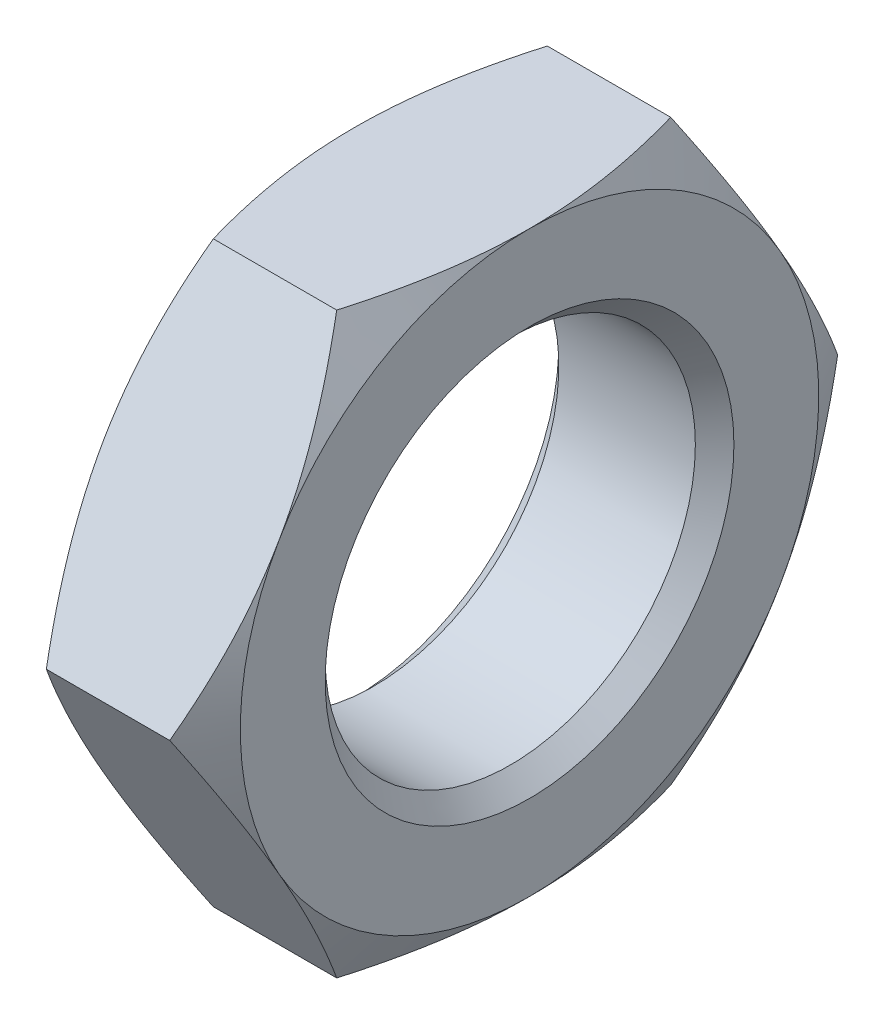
ISO-10303-21;
HEADER;
FILE_DESCRIPTION(('STEP AP214'),'2;1');
FILE_NAME('part.step','',(''),(''),'','','');
FILE_SCHEMA(('AUTOMOTIVE_DESIGN { 1 0 10303 214 1 1 1 1 }'));
ENDSEC;
DATA;
#1=APPLICATION_CONTEXT('core data for automotive mechanical design processes');
#2=APPLICATION_PROTOCOL_DEFINITION('international standard','automotive_design',2000,#1);
#3=PRODUCT_CONTEXT('',#1,'mechanical');
#4=PRODUCT('Part','Part','',(#3));
#5=PRODUCT_RELATED_PRODUCT_CATEGORY('part','',(#4));
#6=PRODUCT_DEFINITION_FORMATION('','',#4);
#7=PRODUCT_DEFINITION_CONTEXT('part definition',#1,'design');
#8=PRODUCT_DEFINITION('design','',#6,#7);
#9=PRODUCT_DEFINITION_SHAPE('','',#8);
#10=(LENGTH_UNIT() NAMED_UNIT(*) SI_UNIT(.MILLI.,.METRE.));
#11=(NAMED_UNIT(*) PLANE_ANGLE_UNIT() SI_UNIT($,.RADIAN.));
#12=(NAMED_UNIT(*) SI_UNIT($,.STERADIAN.) SOLID_ANGLE_UNIT());
#13=UNCERTAINTY_MEASURE_WITH_UNIT(LENGTH_MEASURE(1.E-05),#10,'distance_accuracy_value','');
#14=(GEOMETRIC_REPRESENTATION_CONTEXT(3) GLOBAL_UNCERTAINTY_ASSIGNED_CONTEXT((#13)) GLOBAL_UNIT_ASSIGNED_CONTEXT((#10,
#11,#12)) REPRESENTATION_CONTEXT('',''));
#15=CARTESIAN_POINT('',(0.,0.,0.));
#16=DIRECTION('',(0.,0.,1.));
#17=DIRECTION('',(1.,0.,0.));
#18=AXIS2_PLACEMENT_3D('',#15,#16,#17);
#19=CARTESIAN_POINT('',(22.7,37.5,-21.650635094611));
#20=DIRECTION('',(1.,0.,0.));
#21=DIRECTION('',(0.,0.,-1.));
#22=AXIS2_PLACEMENT_3D('',#19,#20,#21);
#23=PLANE('',#22);
#24=CARTESIAN_POINT('',(22.7,0.,0.));
#25=DIRECTION('',(1.,0.,0.));
#26=DIRECTION('',(0.,0.,-1.));
#27=AXIS2_PLACEMENT_3D('',#24,#25,#26);
#28=CIRCLE('',#27,26.5);
#29=CARTESIAN_POINT('',(22.7,0.,-26.5));
#30=VERTEX_POINT('',#29);
#31=EDGE_CURVE('E11',#30,#30,#28,.F.);
#32=ORIENTED_EDGE('',*,*,#31,.T.);
#33=EDGE_LOOP('',(#32));
#34=FACE_BOUND('',#33,.T.);
#35=CARTESIAN_POINT('',(22.7,0.,0.));
#36=DIRECTION('',(1.,0.,0.));
#37=DIRECTION('',(0.,0.,-1.));
#38=AXIS2_PLACEMENT_3D('',#35,#36,#37);
#39=CIRCLE('',#38,37.5);
#40=CARTESIAN_POINT('',(22.7,-37.5,0.));
#41=VERTEX_POINT('',#40);
#42=CARTESIAN_POINT('',(22.7,-18.75,-32.4759526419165));
#43=VERTEX_POINT('',#42);
#44=EDGE_CURVE('E142',#41,#43,#39,.T.);
#45=ORIENTED_EDGE('',*,*,#44,.T.);
#46=CARTESIAN_POINT('',(22.7,18.75,-32.4759526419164));
#47=VERTEX_POINT('',#46);
#48=EDGE_CURVE('E130',#43,#47,#39,.T.);
#49=ORIENTED_EDGE('',*,*,#48,.T.);
#50=CARTESIAN_POINT('',(22.7,37.5,0.));
#51=VERTEX_POINT('',#50);
#52=EDGE_CURVE('E144',#47,#51,#39,.T.);
#53=ORIENTED_EDGE('',*,*,#52,.T.);
#54=CARTESIAN_POINT('',(22.7,18.75,32.4759526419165));
#55=VERTEX_POINT('',#54);
#56=EDGE_CURVE('E55',#51,#55,#39,.T.);
#57=ORIENTED_EDGE('',*,*,#56,.T.);
#58=CARTESIAN_POINT('',(22.7,-18.75,32.4759526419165));
#59=VERTEX_POINT('',#58);
#60=EDGE_CURVE('E63',#55,#59,#39,.T.);
#61=ORIENTED_EDGE('',*,*,#60,.T.);
#62=EDGE_CURVE('E166',#59,#41,#39,.T.);
#63=ORIENTED_EDGE('',*,*,#62,.T.);
#64=EDGE_LOOP('',(#45,#49,#53,#57,#61,#63));
#65=FACE_BOUND('',#64,.T.);
#66=ADVANCED_FACE('F39',(#34,#65),#23,.T.);
#67=CARTESIAN_POINT('',(0.,37.5,-21.650635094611));
#68=DIRECTION('',(1.,0.,0.));
#69=DIRECTION('',(0.,0.,-1.));
#70=AXIS2_PLACEMENT_3D('',#67,#68,#69);
#71=PLANE('',#70);
#72=CARTESIAN_POINT('',(0.,0.,0.));
#73=DIRECTION('',(1.,0.,0.));
#74=DIRECTION('',(0.,0.,-1.));
#75=AXIS2_PLACEMENT_3D('',#72,#73,#74);
#76=CIRCLE('',#75,26.5);
#77=CARTESIAN_POINT('',(0.,0.,26.5));
#78=VERTEX_POINT('',#77);
#79=EDGE_CURVE('E164',#78,#78,#76,.T.);
#80=ORIENTED_EDGE('',*,*,#79,.T.);
#81=EDGE_LOOP('',(#80));
#82=FACE_BOUND('',#81,.T.);
#83=CARTESIAN_POINT('',(0.,0.,0.));
#84=DIRECTION('',(1.,0.,0.));
#85=DIRECTION('',(0.,0.,-1.));
#86=AXIS2_PLACEMENT_3D('',#83,#84,#85);
#87=CIRCLE('',#86,37.5);
#88=CARTESIAN_POINT('',(0.,-18.75,-32.4759526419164));
#89=VERTEX_POINT('',#88);
#90=CARTESIAN_POINT('',(0.,18.75,-32.4759526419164));
#91=VERTEX_POINT('',#90);
#92=EDGE_CURVE('E173',#89,#91,#87,.T.);
#93=ORIENTED_EDGE('',*,*,#92,.F.);
#94=CARTESIAN_POINT('',(0.,-37.5,0.));
#95=VERTEX_POINT('',#94);
#96=EDGE_CURVE('E318',#95,#89,#87,.T.);
#97=ORIENTED_EDGE('',*,*,#96,.F.);
#98=CARTESIAN_POINT('',(0.,-18.75,32.4759526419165));
#99=VERTEX_POINT('',#98);
#100=EDGE_CURVE('E321',#99,#95,#87,.T.);
#101=ORIENTED_EDGE('',*,*,#100,.F.);
#102=CARTESIAN_POINT('',(0.,18.75,32.4759526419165));
#103=VERTEX_POINT('',#102);
#104=EDGE_CURVE('E325',#103,#99,#87,.T.);
#105=ORIENTED_EDGE('',*,*,#104,.F.);
#106=CARTESIAN_POINT('',(0.,37.5,0.));
#107=VERTEX_POINT('',#106);
#108=EDGE_CURVE('E178',#107,#103,#87,.T.);
#109=ORIENTED_EDGE('',*,*,#108,.F.);
#110=EDGE_CURVE('E174',#91,#107,#87,.T.);
#111=ORIENTED_EDGE('',*,*,#110,.F.);
#112=EDGE_LOOP('',(#93,#97,#101,#105,#109,#111));
#113=FACE_BOUND('',#112,.T.);
#114=ADVANCED_FACE('F319',(#82,#113),#71,.F.);
#115=CARTESIAN_POINT('',(22.7,0.,0.));
#116=DIRECTION('',(-1.,0.,0.));
#117=DIRECTION('',(0.,0.,1.));
#118=AXIS2_PLACEMENT_3D('',#115,#116,#117);
#119=CYLINDRICAL_SURFACE('',#118,24.);
#120=CARTESIAN_POINT('',(2.50000000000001,0.,0.));
#121=DIRECTION('',(1.,0.,0.));
#122=DIRECTION('',(0.,0.,-1.));
#123=AXIS2_PLACEMENT_3D('',#120,#121,#122);
#124=CIRCLE('',#123,24.);
#125=CARTESIAN_POINT('',(2.50000000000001,0.,24.));
#126=VERTEX_POINT('',#125);
#127=EDGE_CURVE('E48',#126,#126,#124,.F.);
#128=ORIENTED_EDGE('',*,*,#127,.T.);
#129=EDGE_LOOP('',(#128));
#130=FACE_BOUND('',#129,.T.);
#131=CARTESIAN_POINT('',(20.2,0.,0.));
#132=DIRECTION('',(1.,0.,0.));
#133=DIRECTION('',(0.,0.,-1.));
#134=AXIS2_PLACEMENT_3D('',#131,#132,#133);
#135=CIRCLE('',#134,24.);
#136=CARTESIAN_POINT('',(20.2,0.,-24.));
#137=VERTEX_POINT('',#136);
#138=EDGE_CURVE('E387',#137,#137,#135,.T.);
#139=ORIENTED_EDGE('',*,*,#138,.T.);
#140=EDGE_LOOP('',(#139));
#141=FACE_BOUND('',#140,.T.);
#142=ADVANCED_FACE('F234',(#130,#141),#119,.F.);
#143=CARTESIAN_POINT('',(0.,0.,0.));
#144=DIRECTION('',(1.,0.,0.));
#145=DIRECTION('',(0.,0.,-1.));
#146=AXIS2_PLACEMENT_3D('',#143,#144,#145);
#147=CONICAL_SURFACE('',#146,37.5,1.0471975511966);
#148=CARTESIAN_POINT('',(3.34943157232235,-37.5002,-21.6505196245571));
#149=CARTESIAN_POINT('',(3.07470860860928,-36.6759672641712,-22.1263906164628));
#150=CARTESIAN_POINT('',(2.8124523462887,-35.8485195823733,-22.6041177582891));
#151=CARTESIAN_POINT('',(2.31633848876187,-34.1869890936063,-23.5634028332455));
#152=CARTESIAN_POINT('',(2.08249023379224,-33.3529041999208,-24.0449619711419));
#153=CARTESIAN_POINT('',(1.64633120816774,-31.6764695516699,-25.0128519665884));
#154=CARTESIAN_POINT('',(1.4440957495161,-30.8341049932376,-25.499191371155));
#155=CARTESIAN_POINT('',(1.07551893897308,-29.1435584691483,-26.4752288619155));
#156=CARTESIAN_POINT('',(0.909174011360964,-28.2953770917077,-26.9649266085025));
#157=CARTESIAN_POINT('',(0.619439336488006,-26.6148770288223,-27.9351637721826));
#158=CARTESIAN_POINT('',(0.495091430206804,-25.782682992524,-28.4156312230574));
#159=CARTESIAN_POINT('',(0.286588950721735,-24.114481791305,-29.3787676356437));
#160=CARTESIAN_POINT('',(0.202435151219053,-23.2784745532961,-29.8614366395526));
#161=CARTESIAN_POINT('',(0.0764456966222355,-21.6050558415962,-30.8275853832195));
#162=CARTESIAN_POINT('',(0.0345597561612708,-20.7676472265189,-31.3110634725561));
#163=CARTESIAN_POINT('',(-0.00599313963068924,-19.092057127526,-32.2784658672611));
#164=CARTESIAN_POINT('',(-0.00466143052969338,-18.2538756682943,-32.7623901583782));
#165=CARTESIAN_POINT('',(0.0382016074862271,-16.6868903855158,-33.6670895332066));
#166=CARTESIAN_POINT('',(0.074506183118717,-15.9579748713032,-34.0879291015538));
#167=CARTESIAN_POINT('',(0.179111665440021,-14.5018822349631,-34.9286045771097));
#168=CARTESIAN_POINT('',(0.247412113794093,-13.7747050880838,-35.348440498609));
#169=CARTESIAN_POINT('',(0.414821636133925,-12.3223664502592,-36.1869486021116));
#170=CARTESIAN_POINT('',(0.51395856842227,-11.5972073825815,-36.6056193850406));
#171=CARTESIAN_POINT('',(0.741301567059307,-10.1503360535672,-37.4409709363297));
#172=CARTESIAN_POINT('',(0.869507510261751,-9.42862377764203,-37.8576517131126));
#173=CARTESIAN_POINT('',(1.15609182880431,-7.97332378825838,-38.6978695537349));
#174=CARTESIAN_POINT('',(1.31507377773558,-7.23982561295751,-39.121354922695));
#175=CARTESIAN_POINT('',(1.65896852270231,-5.77731857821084,-39.9657337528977));
#176=CARTESIAN_POINT('',(1.84388483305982,-5.04831034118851,-40.386626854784));
#177=CARTESIAN_POINT('',(2.23684998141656,-3.59649260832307,-41.2248342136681));
#178=CARTESIAN_POINT('',(2.44485355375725,-2.87367387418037,-41.6421538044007));
#179=CARTESIAN_POINT('',(2.88191810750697,-1.4330358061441,-42.4739065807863));
#180=CARTESIAN_POINT('',(3.11097315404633,-0.715215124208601,-42.8883405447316));
#181=CARTESIAN_POINT('',(3.34943157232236,0.000200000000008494,-43.3013856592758));
#182=B_SPLINE_CURVE_WITH_KNOTS('',3,(#148,#149,#150,#151,#152,#153,#154,#155,#156,#157,#158,
#159,#160,#161,#162,#163,#164,#165,#166,#167,#168,#169,#170,#171,#172,#173,#174,#175,#176,#177,
#178,#179,#180,#181),.UNSPECIFIED.,.F.,.F.,(4,2,2,2,2,2,2,2,2,2,2,2,2,2,2,2,4),(0.,
2.97187343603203,5.94472136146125,8.92454705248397,11.9040757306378,14.8101256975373,
17.7162316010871,20.6188760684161,23.5214308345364,26.0482071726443,28.5749473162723,
31.1039768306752,33.6329956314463,36.2178417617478,38.8030384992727,41.3832532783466,
43.9627428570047),.UNSPECIFIED.);
#183=CARTESIAN_POINT('',(3.34936490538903,0.,-43.3012701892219));
#184=VERTEX_POINT('',#183);
#185=EDGE_CURVE('E330',#89,#184,#182,.T.);
#186=ORIENTED_EDGE('',*,*,#185,.F.);
#187=ORIENTED_EDGE('',*,*,#92,.T.);
#188=CARTESIAN_POINT('',(3.34943157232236,-0.000199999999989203,-43.3013856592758));
#189=CARTESIAN_POINT('',(3.07470860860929,0.824032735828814,-42.8255146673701));
#190=CARTESIAN_POINT('',(2.81245234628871,1.65148041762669,-42.3477875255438));
#191=CARTESIAN_POINT('',(2.31633848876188,3.31301090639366,-41.3885024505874));
#192=CARTESIAN_POINT('',(2.08249023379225,4.14709580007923,-40.906943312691));
#193=CARTESIAN_POINT('',(1.64633120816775,5.82353044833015,-39.9390533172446));
#194=CARTESIAN_POINT('',(1.44409574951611,6.66589500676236,-39.4527139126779));
#195=CARTESIAN_POINT('',(1.07551893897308,8.35644153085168,-38.4766764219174));
#196=CARTESIAN_POINT('',(0.909174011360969,9.20462290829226,-37.9869786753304));
#197=CARTESIAN_POINT('',(0.619439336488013,10.8851229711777,-37.0167415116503));
#198=CARTESIAN_POINT('',(0.495091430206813,11.717317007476,-36.5362740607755));
#199=CARTESIAN_POINT('',(0.286588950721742,13.385518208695,-35.5731376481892));
#200=CARTESIAN_POINT('',(0.202435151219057,14.2215254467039,-35.0904686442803));
#201=CARTESIAN_POINT('',(0.0764456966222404,15.8949441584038,-34.1243199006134));
#202=CARTESIAN_POINT('',(0.0345597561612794,16.7323527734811,-33.6408418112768));
#203=CARTESIAN_POINT('',(-0.00599313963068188,18.407942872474,-32.6734394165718));
#204=CARTESIAN_POINT('',(-0.00466143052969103,19.2461243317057,-32.1895151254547));
#205=CARTESIAN_POINT('',(0.0382016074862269,20.8131096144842,-31.2848157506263));
#206=CARTESIAN_POINT('',(0.0745061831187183,21.5420251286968,-30.8639761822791));
#207=CARTESIAN_POINT('',(0.179111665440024,22.9981177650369,-30.0233007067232));
#208=CARTESIAN_POINT('',(0.247412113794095,23.7252949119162,-29.6034647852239));
#209=CARTESIAN_POINT('',(0.414821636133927,25.1776335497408,-28.7649566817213));
#210=CARTESIAN_POINT('',(0.513958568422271,25.9027926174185,-28.3462858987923));
#211=CARTESIAN_POINT('',(0.741301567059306,27.3496639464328,-27.5109343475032));
#212=CARTESIAN_POINT('',(0.869507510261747,28.071376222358,-27.0942535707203));
#213=CARTESIAN_POINT('',(1.15609182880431,29.5266762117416,-26.254035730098));
#214=CARTESIAN_POINT('',(1.31507377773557,30.2601743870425,-25.8305503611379));
#215=CARTESIAN_POINT('',(1.6589685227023,31.7226814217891,-24.9861715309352));
#216=CARTESIAN_POINT('',(1.84388483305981,32.4516896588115,-24.5652784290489));
#217=CARTESIAN_POINT('',(2.23684998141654,33.9035073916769,-23.7270710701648));
#218=CARTESIAN_POINT('',(2.44485355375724,34.6263261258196,-23.3097514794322));
#219=CARTESIAN_POINT('',(2.88191810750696,36.0669641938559,-22.4779987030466));
#220=CARTESIAN_POINT('',(3.11097315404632,36.7847848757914,-22.0635647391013));
#221=CARTESIAN_POINT('',(3.34943157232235,37.5002,-21.6505196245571));
#222=B_SPLINE_CURVE_WITH_KNOTS('',3,(#188,#189,#190,#191,#192,#193,#194,#195,#196,#197,#198,
#199,#200,#201,#202,#203,#204,#205,#206,#207,#208,#209,#210,#211,#212,#213,#214,#215,#216,#217,
#218,#219,#220,#221),.UNSPECIFIED.,.F.,.F.,(4,2,2,2,2,2,2,2,2,2,2,2,2,2,2,2,4),(0.,
2.97187343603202,5.94472136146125,8.92454705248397,11.9040757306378,14.8101256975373,
17.7162316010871,20.6188760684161,23.5214308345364,26.0482071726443,28.5749473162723,
31.1039768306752,33.6329956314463,36.2178417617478,38.8030384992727,41.3832532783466,
43.9627428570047),.UNSPECIFIED.);
#223=EDGE_CURVE('E215',#184,#91,#222,.T.);
#224=ORIENTED_EDGE('',*,*,#223,.F.);
#225=EDGE_LOOP('',(#186,#187,#224));
#226=FACE_BOUND('',#225,.T.);
#227=ADVANCED_FACE('F194',(#226),#147,.T.);
#228=ORIENTED_EDGE('',*,*,#96,.T.);
#229=CARTESIAN_POINT('',(3.34936490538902,-37.5,-21.650635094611));
#230=VERTEX_POINT('',#229);
#231=EDGE_CURVE('E156',#230,#89,#182,.T.);
#232=ORIENTED_EDGE('',*,*,#231,.F.);
#233=CARTESIAN_POINT('',(18.4863243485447,-37.5,-58.5378214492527));
#234=CARTESIAN_POINT('',(18.0874466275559,-37.5,-57.7173155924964));
#235=CARTESIAN_POINT('',(17.6905231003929,-37.5,-56.8958565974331));
#236=CARTESIAN_POINT('',(16.9010399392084,-37.5,-55.2508348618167));
#237=CARTESIAN_POINT('',(16.5084803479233,-37.5,-54.4272721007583));
#238=CARTESIAN_POINT('',(15.7281295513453,-37.5,-52.7777370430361));
#239=CARTESIAN_POINT('',(15.3403390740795,-37.5,-51.9517644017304));
#240=CARTESIAN_POINT('',(14.5701277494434,-37.5,-50.2973202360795));
#241=CARTESIAN_POINT('',(14.187706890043,-37.5,-49.4688487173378));
#242=CARTESIAN_POINT('',(13.4268221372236,-37.5,-47.8047435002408));
#243=CARTESIAN_POINT('',(13.048390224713,-37.5,-46.9690951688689));
#244=CARTESIAN_POINT('',(12.2982846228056,-37.5,-45.294771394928));
#245=CARTESIAN_POINT('',(11.926610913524,-37.5,-44.4560959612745));
#246=CARTESIAN_POINT('',(11.190850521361,-37.5,-42.7754564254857));
#247=CARTESIAN_POINT('',(10.8267635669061,-37.5,-41.9334924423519));
#248=CARTESIAN_POINT('',(10.1071043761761,-37.5,-40.2459387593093));
#249=CARTESIAN_POINT('',(9.75153206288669,-37.5,-39.4003490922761));
#250=CARTESIAN_POINT('',(9.0383883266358,-37.5,-37.6771977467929));
#251=CARTESIAN_POINT('',(8.681138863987,-37.5,-36.7995026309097));
#252=CARTESIAN_POINT('',(7.97823948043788,-37.5,-35.0394708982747));
#253=CARTESIAN_POINT('',(7.63258958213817,-37.5,-34.1571342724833));
#254=CARTESIAN_POINT('',(6.95442495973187,-37.5,-32.3872909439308));
#255=CARTESIAN_POINT('',(6.62191189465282,-37.5,-31.4997836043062));
#256=CARTESIAN_POINT('',(5.97188187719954,-37.5,-29.7192863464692));
#257=CARTESIAN_POINT('',(5.65436486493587,-37.5,-28.8262964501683));
#258=CARTESIAN_POINT('',(5.03701690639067,-37.5,-27.0362079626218));
#259=CARTESIAN_POINT('',(4.73715185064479,-37.5,-26.1391211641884));
#260=CARTESIAN_POINT('',(4.15675171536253,-37.5,-24.3386807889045));
#261=CARTESIAN_POINT('',(3.87621696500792,-37.5,-23.4353271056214));
#262=CARTESIAN_POINT('',(3.33716756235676,-37.5,-21.6223140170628));
#263=CARTESIAN_POINT('',(3.0786470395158,-37.5,-20.7126563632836));
#264=CARTESIAN_POINT('',(2.58641753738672,-37.5,-18.8866595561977));
#265=CARTESIAN_POINT('',(2.35270768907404,-37.5,-17.9703206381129));
#266=CARTESIAN_POINT('',(1.91439580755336,-37.5,-16.1361384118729));
#267=CARTESIAN_POINT('',(1.70963707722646,-37.5,-15.2183327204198));
#268=CARTESIAN_POINT('',(1.3307897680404,-37.5,-13.3763984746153));
#269=CARTESIAN_POINT('',(1.1567005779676,-37.5,-12.4522700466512));
#270=CARTESIAN_POINT('',(0.842244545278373,-37.5,-10.5982944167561));
#271=CARTESIAN_POINT('',(0.701876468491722,-37.5,-9.66844742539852));
#272=CARTESIAN_POINT('',(0.457638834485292,-37.5,-7.80394049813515));
#273=CARTESIAN_POINT('',(0.353769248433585,-37.5,-6.86928056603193));
#274=CARTESIAN_POINT('',(0.185924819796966,-37.5,-5.00887564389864));
#275=CARTESIAN_POINT('',(0.121438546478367,-37.5,-4.08317707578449));
#276=CARTESIAN_POINT('',(0.0316914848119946,-37.5,-2.22988047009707));
#277=CARTESIAN_POINT('',(0.00643003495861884,-37.5,-1.30228246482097));
#278=CARTESIAN_POINT('',(-0.00426998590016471,-37.5,0.553142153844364));
#279=CARTESIAN_POINT('',(0.0102915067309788,-37.5,1.48096876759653));
#280=CARTESIAN_POINT('',(0.0788963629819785,-37.5,3.33520727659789));
#281=CARTESIAN_POINT('',(0.1329414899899,-37.5,4.26161910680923));
#282=CARTESIAN_POINT('',(0.257111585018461,-37.5,5.83153109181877));
#283=CARTESIAN_POINT('',(0.317424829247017,-37.5,6.47582757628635));
#284=CARTESIAN_POINT('',(0.455976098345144,-37.5,7.76249754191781));
#285=CARTESIAN_POINT('',(0.534214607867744,-37.5,8.40487097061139));
#286=CARTESIAN_POINT('',(0.794682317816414,-37.5,10.3285965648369));
#287=CARTESIAN_POINT('',(1.00266149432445,-37.5,11.6065269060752));
#288=CARTESIAN_POINT('',(1.47993012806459,-37.5,14.1516952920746));
#289=CARTESIAN_POINT('',(1.7492662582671,-37.5,15.4189244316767));
#290=CARTESIAN_POINT('',(2.34099821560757,-37.5,17.9408218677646));
#291=CARTESIAN_POINT('',(2.66339332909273,-37.5,19.1954903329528));
#292=CARTESIAN_POINT('',(3.36105985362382,-37.5,21.7200516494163));
#293=CARTESIAN_POINT('',(3.73734907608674,-37.5,22.9896611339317));
#294=CARTESIAN_POINT('',(4.52957456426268,-37.5,25.5163781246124));
#295=CARTESIAN_POINT('',(4.94551109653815,-37.5,26.7734855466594));
#296=CARTESIAN_POINT('',(5.81036194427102,-37.5,29.2758159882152));
#297=CARTESIAN_POINT('',(6.25926581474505,-37.5,30.5210426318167));
#298=CARTESIAN_POINT('',(6.95333700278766,-37.5,32.3810903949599));
#299=CARTESIAN_POINT('',(7.1881464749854,-37.5,32.9998072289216));
#300=CARTESIAN_POINT('',(7.66409606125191,-37.5,34.234805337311));
#301=CARTESIAN_POINT('',(7.90523619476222,-37.5,34.8510866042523));
#302=CARTESIAN_POINT('',(8.49210492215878,-37.5,36.3304094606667));
#303=CARTESIAN_POINT('',(8.84064972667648,-37.5,37.1923337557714));
#304=CARTESIAN_POINT('',(9.54782981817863,-37.5,38.9120397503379));
#305=CARTESIAN_POINT('',(9.90646524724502,-37.5,39.7698213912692));
#306=CARTESIAN_POINT('',(10.6326882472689,-37.5,41.4816345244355));
#307=CARTESIAN_POINT('',(11.0002762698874,-37.5,42.3356658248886));
#308=CARTESIAN_POINT('',(11.74339322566,-37.5,44.0402693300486));
#309=CARTESIAN_POINT('',(12.1189222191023,-37.5,44.8908415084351));
#310=CARTESIAN_POINT('',(13.2562601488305,-37.5,47.4382310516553));
#311=CARTESIAN_POINT('',(14.0286521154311,-37.5,49.1303278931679));
#312=CARTESIAN_POINT('',(15.5959175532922,-37.5,52.5039889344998));
#313=CARTESIAN_POINT('',(16.390790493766,-37.5,54.185553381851));
#314=CARTESIAN_POINT('',(17.9996890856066,-37.5,57.541900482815));
#315=CARTESIAN_POINT('',(18.8137360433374,-37.5,59.2166729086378));
#316=CARTESIAN_POINT('',(20.456751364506,-37.5,62.5588807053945));
#317=CARTESIAN_POINT('',(21.2857197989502,-37.5,64.2263160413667));
#318=CARTESIAN_POINT('',(22.9558639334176,-37.5,67.554766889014));
#319=CARTESIAN_POINT('',(23.7970379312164,-37.5,69.2157832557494));
#320=CARTESIAN_POINT('',(25.4896577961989,-37.5,72.5325652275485));
#321=CARTESIAN_POINT('',(26.3411036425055,-37.5,74.1883308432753));
#322=CARTESIAN_POINT('',(27.9785889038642,-37.5,77.3522946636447));
#323=CARTESIAN_POINT('',(28.7639123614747,-37.5,78.8608637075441));
#324=CARTESIAN_POINT('',(30.3407718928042,-37.5,81.8747531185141));
#325=CARTESIAN_POINT('',(31.1323079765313,-37.5,83.3800734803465));
#326=CARTESIAN_POINT('',(32.7207875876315,-37.5,86.3879279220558));
#327=CARTESIAN_POINT('',(33.5177313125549,-37.5,87.8904618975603));
#328=CARTESIAN_POINT('',(35.1163053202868,-37.5,90.8930349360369));
#329=CARTESIAN_POINT('',(35.9179356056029,-37.5,92.3930739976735));
#330=CARTESIAN_POINT('',(37.5231820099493,-37.5,95.3869977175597));
#331=CARTESIAN_POINT('',(38.3267873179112,-37.5,96.8808881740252));
#332=CARTESIAN_POINT('',(39.9375962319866,-37.5,99.8667280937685));
#333=CARTESIAN_POINT('',(40.7447998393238,-37.5,101.358677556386));
#334=CARTESIAN_POINT('',(42.3623419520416,-37.5,104.340763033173));
#335=CARTESIAN_POINT('',(43.172680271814,-37.5,105.830899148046));
#336=CARTESIAN_POINT('',(44.7961949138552,-37.5,108.80962172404));
#337=CARTESIAN_POINT('',(45.6093712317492,-37.5,110.298208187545));
#338=CARTESIAN_POINT('',(46.4237959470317,-37.5,111.786110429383));
#339=B_SPLINE_CURVE_WITH_KNOTS('',3,(#233,#234,#235,#236,#237,#238,#239,#240,#241,#242,#243,
#244,#245,#246,#247,#248,#249,#250,#251,#252,#253,#254,#255,#256,#257,#258,#259,#260,#261,#262,
#263,#264,#265,#266,#267,#268,#269,#270,#271,#272,#273,#274,#275,#276,#277,#278,#279,#280,#281,
#282,#283,#284,#285,#286,#287,#288,#289,#290,#291,#292,#293,#294,#295,#296,#297,#298,#299,#300,
#301,#302,#303,#304,#305,#306,#307,#308,#309,#310,#311,#312,#313,#314,#315,#316,#317,#318,#319,
#320,#321,#322,#323,#324,#325,#326,#327,#328,#329,#330,#331,#332,#333,#334,#335,#336,#337,#338),
.UNSPECIFIED.,.F.,.F.,(4,2,2,2,2,2,2,2,2,2,2,2,2,2,2,2,2,2,2,2,2,2,2,2,2,2,2,2,2,2,2,2,2,2,2,2,
2,2,2,2,2,2,2,2,2,2,2,2,2,2,2,2,4),(0.,2.73697065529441,5.47396809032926,8.21137828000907,
10.9487823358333,13.7007856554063,16.4527808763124,19.204677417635,21.9565490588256,
24.7993237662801,27.6421040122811,30.485242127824,33.328368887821,36.1658081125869,
39.0032956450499,41.8400241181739,44.676653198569,47.497287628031,50.3178658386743,
53.1383408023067,55.9588135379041,58.7418344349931,61.5248083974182,64.3077868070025,
67.090889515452,69.0319835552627,70.9731300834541,74.8555046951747,78.7408424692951,
82.6261279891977,86.597953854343,90.5698064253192,94.5404059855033,96.525703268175,
98.5110066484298,101.300119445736,104.089271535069,106.878564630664,109.667878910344,
115.247790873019,120.827571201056,126.413875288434,132.0002059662,137.585764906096,
143.171312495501,148.273513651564,153.375723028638,158.478119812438,163.58051932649,
168.66946375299,173.758409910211,178.847059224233,183.935700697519),.UNSPECIFIED.);
#340=EDGE_CURVE('E177',#95,#230,#339,.F.);
#341=ORIENTED_EDGE('',*,*,#340,.F.);
#342=EDGE_LOOP('',(#228,#232,#341));
#343=FACE_BOUND('',#342,.T.);
#344=ADVANCED_FACE('F350',(#343),#147,.T.);
#345=CARTESIAN_POINT('',(11.35,0.,0.));
#346=DIRECTION('',(-1.,0.,0.));
#347=DIRECTION('',(0.,0.,1.));
#348=AXIS2_PLACEMENT_3D('',#345,#346,#347);
#349=CONICAL_SURFACE('',#348,57.1587766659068,1.0471975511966);
#350=CARTESIAN_POINT('',(19.3505684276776,0.000200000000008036,-43.3013856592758));
#351=CARTESIAN_POINT('',(19.6252913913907,-0.824032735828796,-42.8255146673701));
#352=CARTESIAN_POINT('',(19.8875476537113,-1.65148041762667,-42.3477875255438));
#353=CARTESIAN_POINT('',(20.3836615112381,-3.31301090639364,-41.3885024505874));
#354=CARTESIAN_POINT('',(20.6175097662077,-4.14709580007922,-40.906943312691));
#355=CARTESIAN_POINT('',(21.0536687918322,-5.82353044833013,-39.9390533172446));
#356=CARTESIAN_POINT('',(21.2559042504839,-6.66589500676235,-39.4527139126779));
#357=CARTESIAN_POINT('',(21.6244810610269,-8.35644153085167,-38.4766764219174));
#358=CARTESIAN_POINT('',(21.790825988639,-9.20462290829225,-37.9869786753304));
#359=CARTESIAN_POINT('',(22.080560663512,-10.8851229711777,-37.0167415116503));
#360=CARTESIAN_POINT('',(22.2049085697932,-11.7173170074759,-36.5362740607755));
#361=CARTESIAN_POINT('',(22.4134110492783,-13.385518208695,-35.5731376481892));
#362=CARTESIAN_POINT('',(22.4975648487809,-14.2215254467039,-35.0904686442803));
#363=CARTESIAN_POINT('',(22.6235543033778,-15.8949441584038,-34.1243199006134));
#364=CARTESIAN_POINT('',(22.6654402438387,-16.7323527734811,-33.6408418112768));
#365=CARTESIAN_POINT('',(22.7059931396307,-18.407942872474,-32.6734394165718));
#366=CARTESIAN_POINT('',(22.7046614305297,-19.2461243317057,-32.1895151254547));
#367=CARTESIAN_POINT('',(22.6617983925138,-20.8131096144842,-31.2848157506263));
#368=CARTESIAN_POINT('',(22.6254938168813,-21.5420251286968,-30.8639761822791));
#369=CARTESIAN_POINT('',(22.52088833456,-22.9981177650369,-30.0233007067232));
#370=CARTESIAN_POINT('',(22.4525878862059,-23.7252949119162,-29.6034647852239));
#371=CARTESIAN_POINT('',(22.2851783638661,-25.1776335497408,-28.7649566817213));
#372=CARTESIAN_POINT('',(22.1860414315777,-25.9027926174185,-28.3462858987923));
#373=CARTESIAN_POINT('',(21.9586984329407,-27.3496639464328,-27.5109343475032));
#374=CARTESIAN_POINT('',(21.8304924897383,-28.071376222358,-27.0942535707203));
#375=CARTESIAN_POINT('',(21.5439081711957,-29.5266762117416,-26.254035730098));
#376=CARTESIAN_POINT('',(21.3849262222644,-30.2601743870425,-25.8305503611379));
#377=CARTESIAN_POINT('',(21.0410314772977,-31.7226814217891,-24.9861715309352));
#378=CARTESIAN_POINT('',(20.8561151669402,-32.4516896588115,-24.5652784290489));
#379=CARTESIAN_POINT('',(20.4631500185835,-33.9035073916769,-23.7270710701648));
#380=CARTESIAN_POINT('',(20.2551464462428,-34.6263261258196,-23.3097514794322));
#381=CARTESIAN_POINT('',(19.818081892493,-36.0669641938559,-22.4779987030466));
#382=CARTESIAN_POINT('',(19.5890268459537,-36.7847848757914,-22.0635647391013));
#383=CARTESIAN_POINT('',(19.3505684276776,-37.5002,-21.6505196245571));
#384=B_SPLINE_CURVE_WITH_KNOTS('',3,(#350,#351,#352,#353,#354,#355,#356,#357,#358,#359,#360,
#361,#362,#363,#364,#365,#366,#367,#368,#369,#370,#371,#372,#373,#374,#375,#376,#377,#378,#379,
#380,#381,#382,#383),.UNSPECIFIED.,.F.,.F.,(4,2,2,2,2,2,2,2,2,2,2,2,2,2,2,2,4),(0.,
2.97187343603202,5.94472136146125,8.92454705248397,11.9040757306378,14.8101256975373,
17.7162316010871,20.6188760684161,23.5214308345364,26.0482071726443,28.5749473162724,
31.1039768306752,33.6329956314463,36.2178417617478,38.8030384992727,41.3832532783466,
43.9627428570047),.UNSPECIFIED.);
#385=CARTESIAN_POINT('',(19.350635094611,-37.5,-21.650635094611));
#386=VERTEX_POINT('',#385);
#387=EDGE_CURVE('E147',#43,#386,#384,.T.);
#388=ORIENTED_EDGE('',*,*,#387,.F.);
#389=ORIENTED_EDGE('',*,*,#44,.F.);
#390=CARTESIAN_POINT('',(4.21367565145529,-37.5,-58.5378214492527));
#391=CARTESIAN_POINT('',(4.6125533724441,-37.5,-57.7173155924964));
#392=CARTESIAN_POINT('',(5.00947689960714,-37.5,-56.8958565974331));
#393=CARTESIAN_POINT('',(5.79896006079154,-37.5,-55.2508348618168));
#394=CARTESIAN_POINT('',(6.19151965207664,-37.5,-54.4272721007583));
#395=CARTESIAN_POINT('',(6.97187044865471,-37.5,-52.7777370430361));
#396=CARTESIAN_POINT('',(7.35966092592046,-37.5,-51.9517644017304));
#397=CARTESIAN_POINT('',(8.12987225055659,-37.5,-50.2973202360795));
#398=CARTESIAN_POINT('',(8.51229310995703,-37.5,-49.4688487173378));
#399=CARTESIAN_POINT('',(9.27317786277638,-37.5,-47.8047435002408));
#400=CARTESIAN_POINT('',(9.65160977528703,-37.5,-46.9690951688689));
#401=CARTESIAN_POINT('',(10.4017153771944,-37.5,-45.294771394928));
#402=CARTESIAN_POINT('',(10.773389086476,-37.5,-44.4560959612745));
#403=CARTESIAN_POINT('',(11.509149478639,-37.5,-42.7754564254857));
#404=CARTESIAN_POINT('',(11.8732364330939,-37.5,-41.933492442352));
#405=CARTESIAN_POINT('',(12.5928956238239,-37.5,-40.2459387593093));
#406=CARTESIAN_POINT('',(12.9484679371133,-37.5,-39.4003490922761));
#407=CARTESIAN_POINT('',(13.6616116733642,-37.5,-37.6771977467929));
#408=CARTESIAN_POINT('',(14.018861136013,-37.5,-36.7995026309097));
#409=CARTESIAN_POINT('',(14.7217605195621,-37.5,-35.0394708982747));
#410=CARTESIAN_POINT('',(15.0674104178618,-37.5,-34.1571342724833));
#411=CARTESIAN_POINT('',(15.7455750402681,-37.5,-32.3872909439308));
#412=CARTESIAN_POINT('',(16.0780881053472,-37.5,-31.4997836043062));
#413=CARTESIAN_POINT('',(16.7281181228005,-37.5,-29.7192863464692));
#414=CARTESIAN_POINT('',(17.0456351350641,-37.5,-28.8262964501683));
#415=CARTESIAN_POINT('',(17.6629830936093,-37.5,-27.0362079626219));
#416=CARTESIAN_POINT('',(17.9628481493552,-37.5,-26.1391211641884));
#417=CARTESIAN_POINT('',(18.5432482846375,-37.5,-24.3386807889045));
#418=CARTESIAN_POINT('',(18.8237830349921,-37.5,-23.4353271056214));
#419=CARTESIAN_POINT('',(19.3628324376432,-37.5,-21.6223140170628));
#420=CARTESIAN_POINT('',(19.6213529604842,-37.5,-20.7126563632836));
#421=CARTESIAN_POINT('',(20.1135824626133,-37.5,-18.8866595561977));
#422=CARTESIAN_POINT('',(20.347292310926,-37.5,-17.9703206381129));
#423=CARTESIAN_POINT('',(20.7856041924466,-37.5,-16.1361384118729));
#424=CARTESIAN_POINT('',(20.9903629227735,-37.5,-15.2183327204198));
#425=CARTESIAN_POINT('',(21.3692102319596,-37.5,-13.3763984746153));
#426=CARTESIAN_POINT('',(21.5432994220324,-37.5,-12.4522700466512));
#427=CARTESIAN_POINT('',(21.8577554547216,-37.5,-10.5982944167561));
#428=CARTESIAN_POINT('',(21.9981235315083,-37.5,-9.66844742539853));
#429=CARTESIAN_POINT('',(22.2423611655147,-37.5,-7.80394049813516));
#430=CARTESIAN_POINT('',(22.3462307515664,-37.5,-6.86928056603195));
#431=CARTESIAN_POINT('',(22.514075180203,-37.5,-5.00887564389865));
#432=CARTESIAN_POINT('',(22.5785614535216,-37.5,-4.0831770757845));
#433=CARTESIAN_POINT('',(22.668308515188,-37.5,-2.22988047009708));
#434=CARTESIAN_POINT('',(22.6935699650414,-37.5,-1.30228246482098));
#435=CARTESIAN_POINT('',(22.7042699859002,-37.5,0.553142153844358));
#436=CARTESIAN_POINT('',(22.689708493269,-37.5,1.48096876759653));
#437=CARTESIAN_POINT('',(22.621103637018,-37.5,3.33520727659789));
#438=CARTESIAN_POINT('',(22.5670585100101,-37.5,4.26161910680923));
#439=CARTESIAN_POINT('',(22.4428884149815,-37.5,5.83153109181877));
#440=CARTESIAN_POINT('',(22.382575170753,-37.5,6.47582757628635));
#441=CARTESIAN_POINT('',(22.2440239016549,-37.5,7.76249754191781));
#442=CARTESIAN_POINT('',(22.1657853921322,-37.5,8.4048709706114));
#443=CARTESIAN_POINT('',(21.9053176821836,-37.5,10.3285965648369));
#444=CARTESIAN_POINT('',(21.6973385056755,-37.5,11.6065269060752));
#445=CARTESIAN_POINT('',(21.2200698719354,-37.5,14.1516952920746));
#446=CARTESIAN_POINT('',(20.9507337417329,-37.5,15.4189244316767));
#447=CARTESIAN_POINT('',(20.3590017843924,-37.5,17.9408218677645));
#448=CARTESIAN_POINT('',(20.0366066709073,-37.5,19.1954903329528));
#449=CARTESIAN_POINT('',(19.3389401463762,-37.5,21.7200516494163));
#450=CARTESIAN_POINT('',(18.9626509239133,-37.5,22.9896611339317));
#451=CARTESIAN_POINT('',(18.1704254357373,-37.5,25.5163781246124));
#452=CARTESIAN_POINT('',(17.7544889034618,-37.5,26.7734855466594));
#453=CARTESIAN_POINT('',(16.889638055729,-37.5,29.2758159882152));
#454=CARTESIAN_POINT('',(16.440734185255,-37.5,30.5210426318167));
#455=CARTESIAN_POINT('',(15.7466629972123,-37.5,32.3810903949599));
#456=CARTESIAN_POINT('',(15.5118535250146,-37.5,32.9998072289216));
#457=CARTESIAN_POINT('',(15.0359039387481,-37.5,34.2348053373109));
#458=CARTESIAN_POINT('',(14.7947638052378,-37.5,34.8510866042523));
#459=CARTESIAN_POINT('',(14.2078950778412,-37.5,36.3304094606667));
#460=CARTESIAN_POINT('',(13.8593502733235,-37.5,37.1923337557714));
#461=CARTESIAN_POINT('',(13.1521701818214,-37.5,38.9120397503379));
#462=CARTESIAN_POINT('',(12.793534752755,-37.5,39.7698213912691));
#463=CARTESIAN_POINT('',(12.0673117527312,-37.5,41.4816345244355));
#464=CARTESIAN_POINT('',(11.6997237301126,-37.5,42.3356658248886));
#465=CARTESIAN_POINT('',(10.95660677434,-37.5,44.0402693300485));
#466=CARTESIAN_POINT('',(10.5810777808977,-37.5,44.8908415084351));
#467=CARTESIAN_POINT('',(9.44373985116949,-37.5,47.4382310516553));
#468=CARTESIAN_POINT('',(8.67134788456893,-37.5,49.1303278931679));
#469=CARTESIAN_POINT('',(7.10408244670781,-37.5,52.5039889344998));
#470=CARTESIAN_POINT('',(6.30920950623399,-37.5,54.185553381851));
#471=CARTESIAN_POINT('',(4.70031091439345,-37.5,57.541900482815));
#472=CARTESIAN_POINT('',(3.8862639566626,-37.5,59.2166729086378));
#473=CARTESIAN_POINT('',(2.24324863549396,-37.5,62.5588807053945));
#474=CARTESIAN_POINT('',(1.41428020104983,-37.5,64.2263160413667));
#475=CARTESIAN_POINT('',(-0.255863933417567,-37.5,67.554766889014));
#476=CARTESIAN_POINT('',(-1.09703793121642,-37.5,69.2157832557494));
#477=CARTESIAN_POINT('',(-2.78965779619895,-37.5,72.5325652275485));
#478=CARTESIAN_POINT('',(-3.64110364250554,-37.5,74.1883308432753));
#479=CARTESIAN_POINT('',(-5.27858890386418,-37.5,77.3522946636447));
#480=CARTESIAN_POINT('',(-6.06391236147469,-37.5,78.860863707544));
#481=CARTESIAN_POINT('',(-7.64077189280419,-37.5,81.8747531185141));
#482=CARTESIAN_POINT('',(-8.43230797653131,-37.5,83.3800734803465));
#483=CARTESIAN_POINT('',(-10.0207875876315,-37.5,86.3879279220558));
#484=CARTESIAN_POINT('',(-10.8177313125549,-37.5,87.8904618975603));
#485=CARTESIAN_POINT('',(-12.4163053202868,-37.5,90.8930349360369));
#486=CARTESIAN_POINT('',(-13.2179356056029,-37.5,92.3930739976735));
#487=CARTESIAN_POINT('',(-14.8231820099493,-37.5,95.3869977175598));
#488=CARTESIAN_POINT('',(-15.6267873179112,-37.5,96.8808881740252));
#489=CARTESIAN_POINT('',(-17.2375962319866,-37.5,99.8667280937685));
#490=CARTESIAN_POINT('',(-18.0447998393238,-37.5,101.358677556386));
#491=CARTESIAN_POINT('',(-19.6623419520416,-37.5,104.340763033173));
#492=CARTESIAN_POINT('',(-20.472680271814,-37.5,105.830899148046));
#493=CARTESIAN_POINT('',(-22.0961949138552,-37.5,108.80962172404));
#494=CARTESIAN_POINT('',(-22.9093712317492,-37.5,110.298208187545));
#495=CARTESIAN_POINT('',(-23.7237959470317,-37.5,111.786110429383));
#496=B_SPLINE_CURVE_WITH_KNOTS('',3,(#390,#391,#392,#393,#394,#395,#396,#397,#398,#399,#400,
#401,#402,#403,#404,#405,#406,#407,#408,#409,#410,#411,#412,#413,#414,#415,#416,#417,#418,#419,
#420,#421,#422,#423,#424,#425,#426,#427,#428,#429,#430,#431,#432,#433,#434,#435,#436,#437,#438,
#439,#440,#441,#442,#443,#444,#445,#446,#447,#448,#449,#450,#451,#452,#453,#454,#455,#456,#457,
#458,#459,#460,#461,#462,#463,#464,#465,#466,#467,#468,#469,#470,#471,#472,#473,#474,#475,#476,
#477,#478,#479,#480,#481,#482,#483,#484,#485,#486,#487,#488,#489,#490,#491,#492,#493,#494,#495),
.UNSPECIFIED.,.F.,.F.,(4,2,2,2,2,2,2,2,2,2,2,2,2,2,2,2,2,2,2,2,2,2,2,2,2,2,2,2,2,2,2,2,2,2,2,2,
2,2,2,2,2,2,2,2,2,2,2,2,2,2,2,2,4),(0.,2.73697065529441,5.47396809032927,8.21137828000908,
10.9487823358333,13.7007856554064,16.4527808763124,19.2046774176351,21.9565490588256,
24.7993237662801,27.6421040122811,30.485242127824,33.328368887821,36.1658081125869,
39.0032956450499,41.8400241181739,44.676653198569,47.497287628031,50.3178658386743,
53.1383408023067,55.9588135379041,58.7418344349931,61.5248083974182,64.3077868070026,
67.090889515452,69.0319835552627,70.9731300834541,74.8555046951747,78.7408424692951,
82.6261279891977,86.597953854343,90.5698064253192,94.5404059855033,96.525703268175,
98.5110066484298,101.300119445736,104.089271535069,106.878564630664,109.667878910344,
115.247790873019,120.827571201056,126.413875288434,132.0002059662,137.585764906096,
143.171312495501,148.273513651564,153.375723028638,158.478119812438,163.58051932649,
168.66946375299,173.758409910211,178.847059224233,183.935700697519),.UNSPECIFIED.);
#497=EDGE_CURVE('E151',#386,#41,#496,.T.);
#498=ORIENTED_EDGE('',*,*,#497,.F.);
#499=EDGE_LOOP('',(#388,#389,#498));
#500=FACE_BOUND('',#499,.T.);
#501=ADVANCED_FACE('F148',(#500),#349,.T.);
#502=ORIENTED_EDGE('',*,*,#48,.F.);
#503=CARTESIAN_POINT('',(19.350635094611,0.,-43.3012701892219));
#504=VERTEX_POINT('',#503);
#505=EDGE_CURVE('E134',#504,#43,#384,.T.);
#506=ORIENTED_EDGE('',*,*,#505,.F.);
#507=CARTESIAN_POINT('',(19.3505684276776,37.5002,-21.6505196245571));
#508=CARTESIAN_POINT('',(19.6252913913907,36.6759672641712,-22.1263906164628));
#509=CARTESIAN_POINT('',(19.8875476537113,35.8485195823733,-22.6041177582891));
#510=CARTESIAN_POINT('',(20.3836615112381,34.1869890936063,-23.5634028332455));
#511=CARTESIAN_POINT('',(20.6175097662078,33.3529041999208,-24.0449619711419));
#512=CARTESIAN_POINT('',(21.0536687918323,31.6764695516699,-25.0128519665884));
#513=CARTESIAN_POINT('',(21.2559042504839,30.8341049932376,-25.499191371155));
#514=CARTESIAN_POINT('',(21.6244810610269,29.1435584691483,-26.4752288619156));
#515=CARTESIAN_POINT('',(21.790825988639,28.2953770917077,-26.9649266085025));
#516=CARTESIAN_POINT('',(22.080560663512,26.6148770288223,-27.9351637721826));
#517=CARTESIAN_POINT('',(22.2049085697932,25.782682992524,-28.4156312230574));
#518=CARTESIAN_POINT('',(22.4134110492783,24.114481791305,-29.3787676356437));
#519=CARTESIAN_POINT('',(22.4975648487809,23.2784745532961,-29.8614366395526));
#520=CARTESIAN_POINT('',(22.6235543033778,21.6050558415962,-30.8275853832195));
#521=CARTESIAN_POINT('',(22.6654402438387,20.7676472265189,-31.3110634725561));
#522=CARTESIAN_POINT('',(22.7059931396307,19.092057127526,-32.2784658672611));
#523=CARTESIAN_POINT('',(22.7046614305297,18.2538756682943,-32.7623901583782));
#524=CARTESIAN_POINT('',(22.6617983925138,16.6868903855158,-33.6670895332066));
#525=CARTESIAN_POINT('',(22.6254938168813,15.9579748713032,-34.0879291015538));
#526=CARTESIAN_POINT('',(22.52088833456,14.5018822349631,-34.9286045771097));
#527=CARTESIAN_POINT('',(22.4525878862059,13.7747050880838,-35.348440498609));
#528=CARTESIAN_POINT('',(22.2851783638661,12.3223664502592,-36.1869486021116));
#529=CARTESIAN_POINT('',(22.1860414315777,11.5972073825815,-36.6056193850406));
#530=CARTESIAN_POINT('',(21.9586984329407,10.1503360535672,-37.4409709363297));
#531=CARTESIAN_POINT('',(21.8304924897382,9.42862377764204,-37.8576517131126));
#532=CARTESIAN_POINT('',(21.5439081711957,7.97332378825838,-38.6978695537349));
#533=CARTESIAN_POINT('',(21.3849262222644,7.23982561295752,-39.121354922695));
#534=CARTESIAN_POINT('',(21.0410314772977,5.77731857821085,-39.9657337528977));
#535=CARTESIAN_POINT('',(20.8561151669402,5.04831034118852,-40.386626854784));
#536=CARTESIAN_POINT('',(20.4631500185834,3.59649260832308,-41.2248342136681));
#537=CARTESIAN_POINT('',(20.2551464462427,2.87367387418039,-41.6421538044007));
#538=CARTESIAN_POINT('',(19.818081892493,1.43303580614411,-42.4739065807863));
#539=CARTESIAN_POINT('',(19.5890268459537,0.71521512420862,-42.8883405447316));
#540=CARTESIAN_POINT('',(19.3505684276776,-0.00019999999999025,-43.3013856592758));
#541=B_SPLINE_CURVE_WITH_KNOTS('',3,(#507,#508,#509,#510,#511,#512,#513,#514,#515,#516,#517,
#518,#519,#520,#521,#522,#523,#524,#525,#526,#527,#528,#529,#530,#531,#532,#533,#534,#535,#536,
#537,#538,#539,#540),.UNSPECIFIED.,.F.,.F.,(4,2,2,2,2,2,2,2,2,2,2,2,2,2,2,2,4),(0.,
2.97187343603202,5.94472136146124,8.92454705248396,11.9040757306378,14.8101256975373,
17.7162316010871,20.6188760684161,23.5214308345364,26.0482071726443,28.5749473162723,
31.1039768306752,33.6329956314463,36.2178417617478,38.8030384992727,41.3832532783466,
43.9627428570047),.UNSPECIFIED.);
#542=EDGE_CURVE('E136',#47,#504,#541,.T.);
#543=ORIENTED_EDGE('',*,*,#542,.F.);
#544=EDGE_LOOP('',(#502,#506,#543));
#545=FACE_BOUND('',#544,.T.);
#546=ADVANCED_FACE('F132',(#545),#349,.T.);
#547=ORIENTED_EDGE('',*,*,#100,.T.);
#548=CARTESIAN_POINT('',(3.34936490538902,-37.5,21.650635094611));
#549=VERTEX_POINT('',#548);
#550=EDGE_CURVE('E187',#549,#95,#339,.F.);
#551=ORIENTED_EDGE('',*,*,#550,.F.);
#552=CARTESIAN_POINT('',(3.34943157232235,0.000200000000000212,43.3013856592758));
#553=CARTESIAN_POINT('',(3.07470860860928,-0.824032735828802,42.8255146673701));
#554=CARTESIAN_POINT('',(2.8124523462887,-1.65148041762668,42.3477875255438));
#555=CARTESIAN_POINT('',(2.31633848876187,-3.31301090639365,41.3885024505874));
#556=CARTESIAN_POINT('',(2.08249023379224,-4.14709580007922,40.906943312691));
#557=CARTESIAN_POINT('',(1.64633120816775,-5.82353044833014,39.9390533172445));
#558=CARTESIAN_POINT('',(1.4440957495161,-6.66589500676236,39.4527139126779));
#559=CARTESIAN_POINT('',(1.07551893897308,-8.35644153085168,38.4766764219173));
#560=CARTESIAN_POINT('',(0.909174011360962,-9.20462290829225,37.9869786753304));
#561=CARTESIAN_POINT('',(0.619439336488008,-10.8851229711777,37.0167415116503));
#562=CARTESIAN_POINT('',(0.495091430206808,-11.717317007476,36.5362740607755));
#563=CARTESIAN_POINT('',(0.286588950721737,-13.385518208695,35.5731376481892));
#564=CARTESIAN_POINT('',(0.20243515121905,-14.2215254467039,35.0904686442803));
#565=CARTESIAN_POINT('',(0.0764456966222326,-15.8949441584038,34.1243199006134));
#566=CARTESIAN_POINT('',(0.034559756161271,-16.7323527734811,33.6408418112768));
#567=CARTESIAN_POINT('',(-0.00599313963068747,-18.407942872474,32.6734394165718));
#568=CARTESIAN_POINT('',(-0.00466143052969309,-19.2461243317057,32.1895151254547));
#569=CARTESIAN_POINT('',(0.038201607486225,-20.8131096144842,31.2848157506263));
#570=CARTESIAN_POINT('',(0.0745061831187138,-21.5420251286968,30.8639761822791));
#571=CARTESIAN_POINT('',(0.179111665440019,-22.9981177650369,30.0233007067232));
#572=CARTESIAN_POINT('',(0.247412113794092,-23.7252949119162,29.6034647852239));
#573=CARTESIAN_POINT('',(0.414821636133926,-25.1776335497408,28.7649566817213));
#574=CARTESIAN_POINT('',(0.513958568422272,-25.9027926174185,28.3462858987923));
#575=CARTESIAN_POINT('',(0.741301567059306,-27.3496639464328,27.5109343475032));
#576=CARTESIAN_POINT('',(0.869507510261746,-28.071376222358,27.0942535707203));
#577=CARTESIAN_POINT('',(1.15609182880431,-29.5266762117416,26.254035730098));
#578=CARTESIAN_POINT('',(1.31507377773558,-30.2601743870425,25.8305503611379));
#579=CARTESIAN_POINT('',(1.65896852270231,-31.7226814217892,24.9861715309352));
#580=CARTESIAN_POINT('',(1.84388483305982,-32.4516896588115,24.5652784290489));
#581=CARTESIAN_POINT('',(2.23684998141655,-33.9035073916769,23.7270710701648));
#582=CARTESIAN_POINT('',(2.44485355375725,-34.6263261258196,23.3097514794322));
#583=CARTESIAN_POINT('',(2.88191810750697,-36.0669641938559,22.4779987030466));
#584=CARTESIAN_POINT('',(3.11097315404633,-36.7847848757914,22.0635647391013));
#585=CARTESIAN_POINT('',(3.34943157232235,-37.5002,21.6505196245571));
#586=B_SPLINE_CURVE_WITH_KNOTS('',3,(#552,#553,#554,#555,#556,#557,#558,#559,#560,#561,#562,
#563,#564,#565,#566,#567,#568,#569,#570,#571,#572,#573,#574,#575,#576,#577,#578,#579,#580,#581,
#582,#583,#584,#585),.UNSPECIFIED.,.F.,.F.,(4,2,2,2,2,2,2,2,2,2,2,2,2,2,2,2,4),(0.,
2.97187343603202,5.94472136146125,8.92454705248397,11.9040757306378,14.8101256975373,
17.7162316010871,20.6188760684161,23.5214308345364,26.0482071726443,28.5749473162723,
31.1039768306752,33.6329956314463,36.2178417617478,38.8030384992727,41.3832532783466,
43.9627428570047),.UNSPECIFIED.);
#587=EDGE_CURVE('E188',#99,#549,#586,.T.);
#588=ORIENTED_EDGE('',*,*,#587,.F.);
#589=EDGE_LOOP('',(#547,#551,#588));
#590=FACE_BOUND('',#589,.T.);
#591=ADVANCED_FACE('F349',(#590),#147,.T.);
#592=CARTESIAN_POINT('',(19.350635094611,-37.5,21.650635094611));
#593=VERTEX_POINT('',#592);
#594=EDGE_CURVE('E216',#41,#593,#496,.T.);
#595=ORIENTED_EDGE('',*,*,#594,.F.);
#596=ORIENTED_EDGE('',*,*,#62,.F.);
#597=CARTESIAN_POINT('',(19.3505684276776,-37.5002,21.6505196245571));
#598=CARTESIAN_POINT('',(19.6252913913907,-36.6759672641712,22.1263906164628));
#599=CARTESIAN_POINT('',(19.8875476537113,-35.8485195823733,22.6041177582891));
#600=CARTESIAN_POINT('',(20.3836615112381,-34.1869890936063,23.5634028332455));
#601=CARTESIAN_POINT('',(20.6175097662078,-33.3529041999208,24.0449619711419));
#602=CARTESIAN_POINT('',(21.0536687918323,-31.6764695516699,25.0128519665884));
#603=CARTESIAN_POINT('',(21.2559042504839,-30.8341049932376,25.499191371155));
#604=CARTESIAN_POINT('',(21.6244810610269,-29.1435584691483,26.4752288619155));
#605=CARTESIAN_POINT('',(21.790825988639,-28.2953770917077,26.9649266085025));
#606=CARTESIAN_POINT('',(22.080560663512,-26.6148770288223,27.9351637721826));
#607=CARTESIAN_POINT('',(22.2049085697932,-25.7826829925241,28.4156312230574));
#608=CARTESIAN_POINT('',(22.4134110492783,-24.114481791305,29.3787676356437));
#609=CARTESIAN_POINT('',(22.4975648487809,-23.2784745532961,29.8614366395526));
#610=CARTESIAN_POINT('',(22.6235543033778,-21.6050558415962,30.8275853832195));
#611=CARTESIAN_POINT('',(22.6654402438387,-20.7676472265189,31.3110634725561));
#612=CARTESIAN_POINT('',(22.7059931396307,-19.092057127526,32.2784658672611));
#613=CARTESIAN_POINT('',(22.7046614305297,-18.2538756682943,32.7623901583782));
#614=CARTESIAN_POINT('',(22.6617983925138,-16.6868903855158,33.6670895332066));
#615=CARTESIAN_POINT('',(22.6254938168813,-15.9579748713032,34.0879291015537));
#616=CARTESIAN_POINT('',(22.52088833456,-14.5018822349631,34.9286045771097));
#617=CARTESIAN_POINT('',(22.4525878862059,-13.7747050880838,35.348440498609));
#618=CARTESIAN_POINT('',(22.2851783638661,-12.3223664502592,36.1869486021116));
#619=CARTESIAN_POINT('',(22.1860414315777,-11.5972073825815,36.6056193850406));
#620=CARTESIAN_POINT('',(21.9586984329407,-10.1503360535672,37.4409709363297));
#621=CARTESIAN_POINT('',(21.8304924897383,-9.42862377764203,37.8576517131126));
#622=CARTESIAN_POINT('',(21.5439081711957,-7.97332378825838,38.6978695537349));
#623=CARTESIAN_POINT('',(21.3849262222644,-7.23982561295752,39.121354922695));
#624=CARTESIAN_POINT('',(21.0410314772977,-5.77731857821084,39.9657337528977));
#625=CARTESIAN_POINT('',(20.8561151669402,-5.04831034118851,40.386626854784));
#626=CARTESIAN_POINT('',(20.4631500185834,-3.59649260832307,41.2248342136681));
#627=CARTESIAN_POINT('',(20.2551464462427,-2.87367387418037,41.6421538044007));
#628=CARTESIAN_POINT('',(19.818081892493,-1.4330358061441,42.4739065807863));
#629=CARTESIAN_POINT('',(19.5890268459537,-0.715215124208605,42.8883405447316));
#630=CARTESIAN_POINT('',(19.3505684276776,0.000200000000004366,43.3013856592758));
#631=B_SPLINE_CURVE_WITH_KNOTS('',3,(#597,#598,#599,#600,#601,#602,#603,#604,#605,#606,#607,
#608,#609,#610,#611,#612,#613,#614,#615,#616,#617,#618,#619,#620,#621,#622,#623,#624,#625,#626,
#627,#628,#629,#630),.UNSPECIFIED.,.F.,.F.,(4,2,2,2,2,2,2,2,2,2,2,2,2,2,2,2,4),(0.,
2.97187343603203,5.94472136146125,8.92454705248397,11.9040757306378,14.8101256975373,
17.7162316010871,20.6188760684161,23.5214308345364,26.0482071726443,28.5749473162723,
31.1039768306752,33.6329956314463,36.2178417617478,38.8030384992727,41.3832532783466,
43.9627428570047),.UNSPECIFIED.);
#632=EDGE_CURVE('E247',#593,#59,#631,.T.);
#633=ORIENTED_EDGE('',*,*,#632,.F.);
#634=EDGE_LOOP('',(#595,#596,#633));
#635=FACE_BOUND('',#634,.T.);
#636=ADVANCED_FACE('F430',(#635),#349,.T.);
#637=ORIENTED_EDGE('',*,*,#104,.T.);
#638=CARTESIAN_POINT('',(3.34936490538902,0.,43.3012701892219));
#639=VERTEX_POINT('',#638);
#640=EDGE_CURVE('E288',#639,#99,#586,.T.);
#641=ORIENTED_EDGE('',*,*,#640,.F.);
#642=CARTESIAN_POINT('',(3.34943157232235,37.5002,21.6505196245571));
#643=CARTESIAN_POINT('',(3.07470860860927,36.6759672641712,22.1263906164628));
#644=CARTESIAN_POINT('',(2.8124523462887,35.8485195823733,22.6041177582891));
#645=CARTESIAN_POINT('',(2.31633848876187,34.1869890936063,23.5634028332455));
#646=CARTESIAN_POINT('',(2.08249023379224,33.3529041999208,24.0449619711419));
#647=CARTESIAN_POINT('',(1.64633120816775,31.6764695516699,25.0128519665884));
#648=CARTESIAN_POINT('',(1.4440957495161,30.8341049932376,25.499191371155));
#649=CARTESIAN_POINT('',(1.07551893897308,29.1435584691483,26.4752288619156));
#650=CARTESIAN_POINT('',(0.909174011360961,28.2953770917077,26.9649266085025));
#651=CARTESIAN_POINT('',(0.619439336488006,26.6148770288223,27.9351637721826));
#652=CARTESIAN_POINT('',(0.495091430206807,25.782682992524,28.4156312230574));
#653=CARTESIAN_POINT('',(0.286588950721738,24.114481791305,29.3787676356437));
#654=CARTESIAN_POINT('',(0.202435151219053,23.278474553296,29.8614366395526));
#655=CARTESIAN_POINT('',(0.0764456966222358,21.6050558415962,30.8275853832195));
#656=CARTESIAN_POINT('',(0.0345597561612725,20.7676472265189,31.3110634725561));
#657=CARTESIAN_POINT('',(-0.00599313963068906,19.092057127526,32.2784658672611));
#658=CARTESIAN_POINT('',(-0.00466143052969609,18.2538756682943,32.7623901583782));
#659=CARTESIAN_POINT('',(0.0382016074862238,16.6868903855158,33.6670895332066));
#660=CARTESIAN_POINT('',(0.0745061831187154,15.9579748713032,34.0879291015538));
#661=CARTESIAN_POINT('',(0.179111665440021,14.5018822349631,34.9286045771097));
#662=CARTESIAN_POINT('',(0.247412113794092,13.7747050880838,35.348440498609));
#663=CARTESIAN_POINT('',(0.414821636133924,12.3223664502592,36.1869486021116));
#664=CARTESIAN_POINT('',(0.51395856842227,11.5972073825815,36.6056193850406));
#665=CARTESIAN_POINT('',(0.741301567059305,10.1503360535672,37.4409709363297));
#666=CARTESIAN_POINT('',(0.869507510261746,9.42862377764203,37.8576517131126));
#667=CARTESIAN_POINT('',(1.15609182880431,7.97332378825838,38.6978695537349));
#668=CARTESIAN_POINT('',(1.31507377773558,7.23982561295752,39.121354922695));
#669=CARTESIAN_POINT('',(1.65896852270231,5.77731857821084,39.9657337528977));
#670=CARTESIAN_POINT('',(1.84388483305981,5.04831034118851,40.386626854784));
#671=CARTESIAN_POINT('',(2.23684998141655,3.59649260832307,41.2248342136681));
#672=CARTESIAN_POINT('',(2.44485355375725,2.87367387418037,41.6421538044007));
#673=CARTESIAN_POINT('',(2.88191810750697,1.4330358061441,42.4739065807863));
#674=CARTESIAN_POINT('',(3.11097315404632,0.715215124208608,42.8883405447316));
#675=CARTESIAN_POINT('',(3.34943157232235,-0.000200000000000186,43.3013856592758));
#676=B_SPLINE_CURVE_WITH_KNOTS('',3,(#642,#643,#644,#645,#646,#647,#648,#649,#650,#651,#652,
#653,#654,#655,#656,#657,#658,#659,#660,#661,#662,#663,#664,#665,#666,#667,#668,#669,#670,#671,
#672,#673,#674,#675),.UNSPECIFIED.,.F.,.F.,(4,2,2,2,2,2,2,2,2,2,2,2,2,2,2,2,4),(0.,
2.97187343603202,5.94472136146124,8.92454705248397,11.9040757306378,14.8101256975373,
17.7162316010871,20.6188760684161,23.5214308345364,26.0482071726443,28.5749473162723,
31.1039768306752,33.6329956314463,36.2178417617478,38.8030384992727,41.3832532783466,
43.9627428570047),.UNSPECIFIED.);
#677=EDGE_CURVE('E282',#103,#639,#676,.T.);
#678=ORIENTED_EDGE('',*,*,#677,.F.);
#679=EDGE_LOOP('',(#637,#641,#678));
#680=FACE_BOUND('',#679,.T.);
#681=ADVANCED_FACE('F232',(#680),#147,.T.);
#682=CARTESIAN_POINT('',(19.350635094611,0.,43.3012701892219));
#683=VERTEX_POINT('',#682);
#684=EDGE_CURVE('E375',#59,#683,#631,.T.);
#685=ORIENTED_EDGE('',*,*,#684,.F.);
#686=ORIENTED_EDGE('',*,*,#60,.F.);
#687=CARTESIAN_POINT('',(19.3505684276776,-0.000199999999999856,43.3013856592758));
#688=CARTESIAN_POINT('',(19.6252913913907,0.824032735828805,42.8255146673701));
#689=CARTESIAN_POINT('',(19.8875476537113,1.65148041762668,42.3477875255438));
#690=CARTESIAN_POINT('',(20.3836615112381,3.31301090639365,41.3885024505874));
#691=CARTESIAN_POINT('',(20.6175097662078,4.14709580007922,40.906943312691));
#692=CARTESIAN_POINT('',(21.0536687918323,5.82353044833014,39.9390533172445));
#693=CARTESIAN_POINT('',(21.2559042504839,6.66589500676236,39.4527139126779));
#694=CARTESIAN_POINT('',(21.6244810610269,8.35644153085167,38.4766764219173));
#695=CARTESIAN_POINT('',(21.790825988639,9.20462290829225,37.9869786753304));
#696=CARTESIAN_POINT('',(22.080560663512,10.8851229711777,37.0167415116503));
#697=CARTESIAN_POINT('',(22.2049085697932,11.717317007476,36.5362740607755));
#698=CARTESIAN_POINT('',(22.4134110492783,13.385518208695,35.5731376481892));
#699=CARTESIAN_POINT('',(22.4975648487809,14.2215254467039,35.0904686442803));
#700=CARTESIAN_POINT('',(22.6235543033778,15.8949441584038,34.1243199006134));
#701=CARTESIAN_POINT('',(22.6654402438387,16.7323527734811,33.6408418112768));
#702=CARTESIAN_POINT('',(22.7059931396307,18.407942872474,32.6734394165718));
#703=CARTESIAN_POINT('',(22.7046614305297,19.2461243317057,32.1895151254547));
#704=CARTESIAN_POINT('',(22.6617983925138,20.8131096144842,31.2848157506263));
#705=CARTESIAN_POINT('',(22.6254938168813,21.5420251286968,30.8639761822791));
#706=CARTESIAN_POINT('',(22.52088833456,22.9981177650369,30.0233007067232));
#707=CARTESIAN_POINT('',(22.4525878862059,23.7252949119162,29.6034647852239));
#708=CARTESIAN_POINT('',(22.2851783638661,25.1776335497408,28.7649566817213));
#709=CARTESIAN_POINT('',(22.1860414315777,25.9027926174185,28.3462858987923));
#710=CARTESIAN_POINT('',(21.9586984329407,27.3496639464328,27.5109343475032));
#711=CARTESIAN_POINT('',(21.8304924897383,28.071376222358,27.0942535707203));
#712=CARTESIAN_POINT('',(21.5439081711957,29.5266762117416,26.254035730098));
#713=CARTESIAN_POINT('',(21.3849262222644,30.2601743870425,25.8305503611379));
#714=CARTESIAN_POINT('',(21.0410314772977,31.7226814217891,24.9861715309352));
#715=CARTESIAN_POINT('',(20.8561151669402,32.4516896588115,24.5652784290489));
#716=CARTESIAN_POINT('',(20.4631500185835,33.9035073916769,23.7270710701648));
#717=CARTESIAN_POINT('',(20.2551464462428,34.6263261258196,23.3097514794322));
#718=CARTESIAN_POINT('',(19.818081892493,36.0669641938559,22.4779987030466));
#719=CARTESIAN_POINT('',(19.5890268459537,36.7847848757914,22.0635647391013));
#720=CARTESIAN_POINT('',(19.3505684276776,37.5002,21.6505196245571));
#721=B_SPLINE_CURVE_WITH_KNOTS('',3,(#687,#688,#689,#690,#691,#692,#693,#694,#695,#696,#697,
#698,#699,#700,#701,#702,#703,#704,#705,#706,#707,#708,#709,#710,#711,#712,#713,#714,#715,#716,
#717,#718,#719,#720),.UNSPECIFIED.,.F.,.F.,(4,2,2,2,2,2,2,2,2,2,2,2,2,2,2,2,4),(0.,
2.97187343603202,5.94472136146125,8.92454705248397,11.9040757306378,14.8101256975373,
17.7162316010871,20.6188760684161,23.5214308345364,26.0482071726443,28.5749473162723,
31.1039768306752,33.6329956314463,36.2178417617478,38.8030384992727,41.3832532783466,
43.9627428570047),.UNSPECIFIED.);
#722=EDGE_CURVE('E371',#683,#55,#721,.T.);
#723=ORIENTED_EDGE('',*,*,#722,.F.);
#724=EDGE_LOOP('',(#685,#686,#723));
#725=FACE_BOUND('',#724,.T.);
#726=ADVANCED_FACE('F227',(#725),#349,.T.);
#727=ORIENTED_EDGE('',*,*,#108,.T.);
#728=CARTESIAN_POINT('',(3.34936490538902,37.5,21.650635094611));
#729=VERTEX_POINT('',#728);
#730=EDGE_CURVE('E281',#729,#103,#676,.T.);
#731=ORIENTED_EDGE('',*,*,#730,.F.);
#732=CARTESIAN_POINT('',(18.4863243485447,37.5,-58.5378214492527));
#733=CARTESIAN_POINT('',(18.0874466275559,37.5,-57.7173155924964));
#734=CARTESIAN_POINT('',(17.6905231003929,37.5,-56.8958565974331));
#735=CARTESIAN_POINT('',(16.9010399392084,37.5,-55.2508348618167));
#736=CARTESIAN_POINT('',(16.5084803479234,37.5,-54.4272721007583));
#737=CARTESIAN_POINT('',(15.7281295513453,37.5,-52.7777370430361));
#738=CARTESIAN_POINT('',(15.3403390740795,37.5,-51.9517644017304));
#739=CARTESIAN_POINT('',(14.5701277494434,37.5,-50.2973202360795));
#740=CARTESIAN_POINT('',(14.187706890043,37.5,-49.4688487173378));
#741=CARTESIAN_POINT('',(13.4268221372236,37.5,-47.8047435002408));
#742=CARTESIAN_POINT('',(13.048390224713,37.5,-46.9690951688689));
#743=CARTESIAN_POINT('',(12.2982846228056,37.5,-45.294771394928));
#744=CARTESIAN_POINT('',(11.926610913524,37.5,-44.4560959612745));
#745=CARTESIAN_POINT('',(11.190850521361,37.5,-42.7754564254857));
#746=CARTESIAN_POINT('',(10.8267635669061,37.5,-41.933492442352));
#747=CARTESIAN_POINT('',(10.1071043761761,37.5,-40.2459387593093));
#748=CARTESIAN_POINT('',(9.75153206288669,37.5,-39.4003490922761));
#749=CARTESIAN_POINT('',(9.0383883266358,37.5,-37.6771977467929));
#750=CARTESIAN_POINT('',(8.68113886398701,37.5,-36.7995026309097));
#751=CARTESIAN_POINT('',(7.97823948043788,37.5,-35.0394708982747));
#752=CARTESIAN_POINT('',(7.63258958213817,37.5,-34.1571342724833));
#753=CARTESIAN_POINT('',(6.95442495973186,37.5,-32.3872909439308));
#754=CARTESIAN_POINT('',(6.62191189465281,37.5,-31.4997836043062));
#755=CARTESIAN_POINT('',(5.97188187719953,37.5,-29.7192863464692));
#756=CARTESIAN_POINT('',(5.65436486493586,37.5,-28.8262964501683));
#757=CARTESIAN_POINT('',(5.03701690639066,37.5,-27.0362079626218));
#758=CARTESIAN_POINT('',(4.73715185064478,37.5,-26.1391211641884));
#759=CARTESIAN_POINT('',(4.15675171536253,37.5,-24.3386807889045));
#760=CARTESIAN_POINT('',(3.87621696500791,37.5,-23.4353271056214));
#761=CARTESIAN_POINT('',(3.33716756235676,37.5,-21.6223140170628));
#762=CARTESIAN_POINT('',(3.0786470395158,37.5,-20.7126563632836));
#763=CARTESIAN_POINT('',(2.58641753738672,37.5,-18.8866595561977));
#764=CARTESIAN_POINT('',(2.35270768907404,37.5,-17.9703206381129));
#765=CARTESIAN_POINT('',(1.91439580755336,37.5,-16.1361384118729));
#766=CARTESIAN_POINT('',(1.70963707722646,37.5,-15.2183327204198));
#767=CARTESIAN_POINT('',(1.3307897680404,37.5,-13.3763984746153));
#768=CARTESIAN_POINT('',(1.1567005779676,37.5,-12.4522700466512));
#769=CARTESIAN_POINT('',(0.842244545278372,37.5,-10.5982944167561));
#770=CARTESIAN_POINT('',(0.701876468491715,37.5,-9.66844742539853));
#771=CARTESIAN_POINT('',(0.457638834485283,37.5,-7.80394049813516));
#772=CARTESIAN_POINT('',(0.353769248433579,37.5,-6.86928056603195));
#773=CARTESIAN_POINT('',(0.185924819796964,37.5,-5.00887564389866));
#774=CARTESIAN_POINT('',(0.121438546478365,37.5,-4.08317707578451));
#775=CARTESIAN_POINT('',(0.0316914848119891,37.5,-2.22988047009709));
#776=CARTESIAN_POINT('',(0.00643003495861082,37.5,-1.30228246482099));
#777=CARTESIAN_POINT('',(-0.00426998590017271,37.5,0.553142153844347));
#778=CARTESIAN_POINT('',(0.0102915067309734,37.5,1.48096876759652));
#779=CARTESIAN_POINT('',(0.0788963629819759,37.5,3.33520727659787));
#780=CARTESIAN_POINT('',(0.132941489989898,37.5,4.26161910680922));
#781=CARTESIAN_POINT('',(0.257111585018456,37.5,5.83153109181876));
#782=CARTESIAN_POINT('',(0.317424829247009,37.5,6.47582757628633));
#783=CARTESIAN_POINT('',(0.455976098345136,37.5,7.76249754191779));
#784=CARTESIAN_POINT('',(0.534214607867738,37.5,8.40487097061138));
#785=CARTESIAN_POINT('',(0.794682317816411,37.5,10.3285965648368));
#786=CARTESIAN_POINT('',(1.00266149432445,37.5,11.6065269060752));
#787=CARTESIAN_POINT('',(1.47993012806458,37.5,14.1516952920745));
#788=CARTESIAN_POINT('',(1.74926625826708,37.5,15.4189244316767));
#789=CARTESIAN_POINT('',(2.34099821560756,37.5,17.9408218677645));
#790=CARTESIAN_POINT('',(2.66339332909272,37.5,19.1954903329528));
#791=CARTESIAN_POINT('',(3.3610598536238,37.5,21.7200516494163));
#792=CARTESIAN_POINT('',(3.73734907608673,37.5,22.9896611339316));
#793=CARTESIAN_POINT('',(4.52957456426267,37.5,25.5163781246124));
#794=CARTESIAN_POINT('',(4.94551109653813,37.5,26.7734855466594));
#795=CARTESIAN_POINT('',(5.810361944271,37.5,29.2758159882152));
#796=CARTESIAN_POINT('',(6.25926581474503,37.5,30.5210426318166));
#797=CARTESIAN_POINT('',(6.95333700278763,37.5,32.3810903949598));
#798=CARTESIAN_POINT('',(7.18814647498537,37.5,32.9998072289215));
#799=CARTESIAN_POINT('',(7.66409606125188,37.5,34.2348053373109));
#800=CARTESIAN_POINT('',(7.90523619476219,37.5,34.8510866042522));
#801=CARTESIAN_POINT('',(8.49210492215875,37.5,36.3304094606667));
#802=CARTESIAN_POINT('',(8.84064972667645,37.5,37.1923337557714));
#803=CARTESIAN_POINT('',(9.5478298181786,37.5,38.9120397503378));
#804=CARTESIAN_POINT('',(9.90646524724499,37.5,39.7698213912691));
#805=CARTESIAN_POINT('',(10.6326882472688,37.5,41.4816345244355));
#806=CARTESIAN_POINT('',(11.0002762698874,37.5,42.3356658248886));
#807=CARTESIAN_POINT('',(11.74339322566,37.5,44.0402693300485));
#808=CARTESIAN_POINT('',(12.1189222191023,37.5,44.890841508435));
#809=CARTESIAN_POINT('',(13.2562601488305,37.5,47.4382310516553));
#810=CARTESIAN_POINT('',(14.0286521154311,37.5,49.1303278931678));
#811=CARTESIAN_POINT('',(15.5959175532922,37.5,52.5039889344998));
#812=CARTESIAN_POINT('',(16.390790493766,37.5,54.185553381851));
#813=CARTESIAN_POINT('',(17.9996890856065,37.5,57.5419004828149));
#814=CARTESIAN_POINT('',(18.8137360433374,37.5,59.2166729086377));
#815=CARTESIAN_POINT('',(20.456751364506,37.5,62.5588807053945));
#816=CARTESIAN_POINT('',(21.2857197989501,37.5,64.2263160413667));
#817=CARTESIAN_POINT('',(22.9558639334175,37.5,67.5547668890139));
#818=CARTESIAN_POINT('',(23.7970379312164,37.5,69.2157832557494));
#819=CARTESIAN_POINT('',(25.4896577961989,37.5,72.5325652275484));
#820=CARTESIAN_POINT('',(26.3411036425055,37.5,74.1883308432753));
#821=CARTESIAN_POINT('',(27.9785889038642,37.5,77.3522946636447));
#822=CARTESIAN_POINT('',(28.7639123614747,37.5,78.860863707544));
#823=CARTESIAN_POINT('',(30.3407718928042,37.5,81.8747531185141));
#824=CARTESIAN_POINT('',(31.1323079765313,37.5,83.3800734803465));
#825=CARTESIAN_POINT('',(32.7207875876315,37.5,86.3879279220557));
#826=CARTESIAN_POINT('',(33.5177313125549,37.5,87.8904618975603));
#827=CARTESIAN_POINT('',(35.1163053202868,37.5,90.8930349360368));
#828=CARTESIAN_POINT('',(35.9179356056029,37.5,92.3930739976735));
#829=CARTESIAN_POINT('',(37.5231820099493,37.5,95.3869977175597));
#830=CARTESIAN_POINT('',(38.3267873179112,37.5,96.8808881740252));
#831=CARTESIAN_POINT('',(39.9375962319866,37.5,99.8667280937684));
#832=CARTESIAN_POINT('',(40.7447998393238,37.5,101.358677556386));
#833=CARTESIAN_POINT('',(42.3623419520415,37.5,104.340763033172));
#834=CARTESIAN_POINT('',(43.172680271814,37.5,105.830899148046));
#835=CARTESIAN_POINT('',(44.7961949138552,37.5,108.80962172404));
#836=CARTESIAN_POINT('',(45.6093712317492,37.5,110.298208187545));
#837=CARTESIAN_POINT('',(46.4237959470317,37.5,111.786110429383));
#838=B_SPLINE_CURVE_WITH_KNOTS('',3,(#732,#733,#734,#735,#736,#737,#738,#739,#740,#741,#742,
#743,#744,#745,#746,#747,#748,#749,#750,#751,#752,#753,#754,#755,#756,#757,#758,#759,#760,#761,
#762,#763,#764,#765,#766,#767,#768,#769,#770,#771,#772,#773,#774,#775,#776,#777,#778,#779,#780,
#781,#782,#783,#784,#785,#786,#787,#788,#789,#790,#791,#792,#793,#794,#795,#796,#797,#798,#799,
#800,#801,#802,#803,#804,#805,#806,#807,#808,#809,#810,#811,#812,#813,#814,#815,#816,#817,#818,
#819,#820,#821,#822,#823,#824,#825,#826,#827,#828,#829,#830,#831,#832,#833,#834,#835,#836,#837),
.UNSPECIFIED.,.F.,.F.,(4,2,2,2,2,2,2,2,2,2,2,2,2,2,2,2,2,2,2,2,2,2,2,2,2,2,2,2,2,2,2,2,2,2,2,2,
2,2,2,2,2,2,2,2,2,2,2,2,2,2,2,2,4),(0.,2.73697065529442,5.47396809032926,8.21137828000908,
10.9487823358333,13.7007856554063,16.4527808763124,19.204677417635,21.9565490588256,
24.7993237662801,27.6421040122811,30.485242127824,33.328368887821,36.1658081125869,
39.0032956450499,41.8400241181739,44.676653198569,47.497287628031,50.3178658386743,
53.1383408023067,55.9588135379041,58.7418344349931,61.5248083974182,64.3077868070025,
67.090889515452,69.0319835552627,70.9731300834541,74.8555046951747,78.7408424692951,
82.6261279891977,86.597953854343,90.5698064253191,94.5404059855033,96.525703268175,
98.5110066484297,101.300119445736,104.089271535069,106.878564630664,109.667878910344,
115.247790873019,120.827571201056,126.413875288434,132.0002059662,137.585764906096,
143.171312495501,148.273513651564,153.375723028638,158.478119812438,163.58051932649,
168.66946375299,173.758409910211,178.847059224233,183.935700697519),.UNSPECIFIED.);
#839=EDGE_CURVE('E274',#107,#729,#838,.T.);
#840=ORIENTED_EDGE('',*,*,#839,.F.);
#841=EDGE_LOOP('',(#727,#731,#840));
#842=FACE_BOUND('',#841,.T.);
#843=ADVANCED_FACE('F231',(#842),#147,.T.);
#844=ORIENTED_EDGE('',*,*,#56,.F.);
#845=CARTESIAN_POINT('',(4.21367565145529,37.5,-58.5378214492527));
#846=CARTESIAN_POINT('',(4.61255337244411,37.5,-57.7173155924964));
#847=CARTESIAN_POINT('',(5.00947689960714,37.5,-56.8958565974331));
#848=CARTESIAN_POINT('',(5.79896006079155,37.5,-55.2508348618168));
#849=CARTESIAN_POINT('',(6.19151965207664,37.5,-54.4272721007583));
#850=CARTESIAN_POINT('',(6.97187044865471,37.5,-52.7777370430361));
#851=CARTESIAN_POINT('',(7.35966092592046,37.5,-51.9517644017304));
#852=CARTESIAN_POINT('',(8.1298722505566,37.5,-50.2973202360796));
#853=CARTESIAN_POINT('',(8.51229310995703,37.5,-49.4688487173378));
#854=CARTESIAN_POINT('',(9.27317786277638,37.5,-47.8047435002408));
#855=CARTESIAN_POINT('',(9.65160977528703,37.5,-46.9690951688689));
#856=CARTESIAN_POINT('',(10.4017153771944,37.5,-45.294771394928));
#857=CARTESIAN_POINT('',(10.773389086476,37.5,-44.4560959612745));
#858=CARTESIAN_POINT('',(11.509149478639,37.5,-42.7754564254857));
#859=CARTESIAN_POINT('',(11.8732364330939,37.5,-41.933492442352));
#860=CARTESIAN_POINT('',(12.5928956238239,37.5,-40.2459387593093));
#861=CARTESIAN_POINT('',(12.9484679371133,37.5,-39.4003490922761));
#862=CARTESIAN_POINT('',(13.6616116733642,37.5,-37.6771977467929));
#863=CARTESIAN_POINT('',(14.018861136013,37.5,-36.7995026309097));
#864=CARTESIAN_POINT('',(14.7217605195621,37.5,-35.0394708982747));
#865=CARTESIAN_POINT('',(15.0674104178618,37.5,-34.1571342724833));
#866=CARTESIAN_POINT('',(15.7455750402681,37.5,-32.3872909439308));
#867=CARTESIAN_POINT('',(16.0780881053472,37.5,-31.4997836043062));
#868=CARTESIAN_POINT('',(16.7281181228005,37.5,-29.7192863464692));
#869=CARTESIAN_POINT('',(17.0456351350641,37.5,-28.8262964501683));
#870=CARTESIAN_POINT('',(17.6629830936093,37.5,-27.0362079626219));
#871=CARTESIAN_POINT('',(17.9628481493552,37.5,-26.1391211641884));
#872=CARTESIAN_POINT('',(18.5432482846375,37.5,-24.3386807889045));
#873=CARTESIAN_POINT('',(18.8237830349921,37.5,-23.4353271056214));
#874=CARTESIAN_POINT('',(19.3628324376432,37.5,-21.6223140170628));
#875=CARTESIAN_POINT('',(19.6213529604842,37.5,-20.7126563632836));
#876=CARTESIAN_POINT('',(20.1135824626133,37.5,-18.8866595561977));
#877=CARTESIAN_POINT('',(20.347292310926,37.5,-17.9703206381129));
#878=CARTESIAN_POINT('',(20.7856041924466,37.5,-16.1361384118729));
#879=CARTESIAN_POINT('',(20.9903629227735,37.5,-15.2183327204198));
#880=CARTESIAN_POINT('',(21.3692102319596,37.5,-13.3763984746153));
#881=CARTESIAN_POINT('',(21.5432994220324,37.5,-12.4522700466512));
#882=CARTESIAN_POINT('',(21.8577554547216,37.5,-10.5982944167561));
#883=CARTESIAN_POINT('',(21.9981235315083,37.5,-9.66844742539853));
#884=CARTESIAN_POINT('',(22.2423611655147,37.5,-7.80394049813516));
#885=CARTESIAN_POINT('',(22.3462307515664,37.5,-6.86928056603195));
#886=CARTESIAN_POINT('',(22.514075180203,37.5,-5.00887564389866));
#887=CARTESIAN_POINT('',(22.5785614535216,37.5,-4.08317707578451));
#888=CARTESIAN_POINT('',(22.668308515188,37.5,-2.22988047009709));
#889=CARTESIAN_POINT('',(22.6935699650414,37.5,-1.30228246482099));
#890=CARTESIAN_POINT('',(22.7042699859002,37.5,0.553142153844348));
#891=CARTESIAN_POINT('',(22.689708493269,37.5,1.48096876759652));
#892=CARTESIAN_POINT('',(22.621103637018,37.5,3.33520727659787));
#893=CARTESIAN_POINT('',(22.5670585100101,37.5,4.26161910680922));
#894=CARTESIAN_POINT('',(22.4428884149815,37.5,5.83153109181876));
#895=CARTESIAN_POINT('',(22.382575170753,37.5,6.47582757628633));
#896=CARTESIAN_POINT('',(22.2440239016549,37.5,7.76249754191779));
#897=CARTESIAN_POINT('',(22.1657853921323,37.5,8.40487097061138));
#898=CARTESIAN_POINT('',(21.9053176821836,37.5,10.3285965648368));
#899=CARTESIAN_POINT('',(21.6973385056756,37.5,11.6065269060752));
#900=CARTESIAN_POINT('',(21.2200698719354,37.5,14.1516952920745));
#901=CARTESIAN_POINT('',(20.9507337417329,37.5,15.4189244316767));
#902=CARTESIAN_POINT('',(20.3590017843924,37.5,17.9408218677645));
#903=CARTESIAN_POINT('',(20.0366066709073,37.5,19.1954903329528));
#904=CARTESIAN_POINT('',(19.3389401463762,37.5,21.7200516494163));
#905=CARTESIAN_POINT('',(18.9626509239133,37.5,22.9896611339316));
#906=CARTESIAN_POINT('',(18.1704254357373,37.5,25.5163781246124));
#907=CARTESIAN_POINT('',(17.7544889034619,37.5,26.7734855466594));
#908=CARTESIAN_POINT('',(16.889638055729,37.5,29.2758159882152));
#909=CARTESIAN_POINT('',(16.440734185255,37.5,30.5210426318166));
#910=CARTESIAN_POINT('',(15.7466629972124,37.5,32.3810903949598));
#911=CARTESIAN_POINT('',(15.5118535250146,37.5,32.9998072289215));
#912=CARTESIAN_POINT('',(15.0359039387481,37.5,34.2348053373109));
#913=CARTESIAN_POINT('',(14.7947638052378,37.5,34.8510866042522));
#914=CARTESIAN_POINT('',(14.2078950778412,37.5,36.3304094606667));
#915=CARTESIAN_POINT('',(13.8593502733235,37.5,37.1923337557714));
#916=CARTESIAN_POINT('',(13.1521701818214,37.5,38.9120397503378));
#917=CARTESIAN_POINT('',(12.793534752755,37.5,39.7698213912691));
#918=CARTESIAN_POINT('',(12.0673117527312,37.5,41.4816345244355));
#919=CARTESIAN_POINT('',(11.6997237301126,37.5,42.3356658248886));
#920=CARTESIAN_POINT('',(10.95660677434,37.5,44.0402693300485));
#921=CARTESIAN_POINT('',(10.5810777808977,37.5,44.890841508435));
#922=CARTESIAN_POINT('',(9.4437398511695,37.5,47.4382310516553));
#923=CARTESIAN_POINT('',(8.67134788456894,37.5,49.1303278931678));
#924=CARTESIAN_POINT('',(7.10408244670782,37.5,52.5039889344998));
#925=CARTESIAN_POINT('',(6.30920950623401,37.5,54.185553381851));
#926=CARTESIAN_POINT('',(4.70031091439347,37.5,57.5419004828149));
#927=CARTESIAN_POINT('',(3.88626395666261,37.5,59.2166729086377));
#928=CARTESIAN_POINT('',(2.24324863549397,37.5,62.5588807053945));
#929=CARTESIAN_POINT('',(1.41428020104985,37.5,64.2263160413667));
#930=CARTESIAN_POINT('',(-0.255863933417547,37.5,67.5547668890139));
#931=CARTESIAN_POINT('',(-1.09703793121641,37.5,69.2157832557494));
#932=CARTESIAN_POINT('',(-2.78965779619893,37.5,72.5325652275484));
#933=CARTESIAN_POINT('',(-3.64110364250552,37.5,74.1883308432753));
#934=CARTESIAN_POINT('',(-5.27858890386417,37.5,77.3522946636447));
#935=CARTESIAN_POINT('',(-6.06391236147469,37.5,78.860863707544));
#936=CARTESIAN_POINT('',(-7.64077189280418,37.5,81.8747531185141));
#937=CARTESIAN_POINT('',(-8.43230797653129,37.5,83.3800734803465));
#938=CARTESIAN_POINT('',(-10.0207875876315,37.5,86.3879279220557));
#939=CARTESIAN_POINT('',(-10.8177313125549,37.5,87.8904618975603));
#940=CARTESIAN_POINT('',(-12.4163053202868,37.5,90.8930349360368));
#941=CARTESIAN_POINT('',(-13.2179356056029,37.5,92.3930739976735));
#942=CARTESIAN_POINT('',(-14.8231820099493,37.5,95.3869977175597));
#943=CARTESIAN_POINT('',(-15.6267873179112,37.5,96.8808881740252));
#944=CARTESIAN_POINT('',(-17.2375962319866,37.5,99.8667280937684));
#945=CARTESIAN_POINT('',(-18.0447998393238,37.5,101.358677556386));
#946=CARTESIAN_POINT('',(-19.6623419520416,37.5,104.340763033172));
#947=CARTESIAN_POINT('',(-20.472680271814,37.5,105.830899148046));
#948=CARTESIAN_POINT('',(-22.0961949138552,37.5,108.80962172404));
#949=CARTESIAN_POINT('',(-22.9093712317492,37.5,110.298208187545));
#950=CARTESIAN_POINT('',(-23.7237959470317,37.5,111.786110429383));
#951=B_SPLINE_CURVE_WITH_KNOTS('',3,(#845,#846,#847,#848,#849,#850,#851,#852,#853,#854,#855,
#856,#857,#858,#859,#860,#861,#862,#863,#864,#865,#866,#867,#868,#869,#870,#871,#872,#873,#874,
#875,#876,#877,#878,#879,#880,#881,#882,#883,#884,#885,#886,#887,#888,#889,#890,#891,#892,#893,
#894,#895,#896,#897,#898,#899,#900,#901,#902,#903,#904,#905,#906,#907,#908,#909,#910,#911,#912,
#913,#914,#915,#916,#917,#918,#919,#920,#921,#922,#923,#924,#925,#926,#927,#928,#929,#930,#931,
#932,#933,#934,#935,#936,#937,#938,#939,#940,#941,#942,#943,#944,#945,#946,#947,#948,#949,#950),
.UNSPECIFIED.,.F.,.F.,(4,2,2,2,2,2,2,2,2,2,2,2,2,2,2,2,2,2,2,2,2,2,2,2,2,2,2,2,2,2,2,2,2,2,2,2,
2,2,2,2,2,2,2,2,2,2,2,2,2,2,2,2,4),(0.,2.73697065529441,5.47396809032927,8.21137828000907,
10.9487823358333,13.7007856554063,16.4527808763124,19.2046774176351,21.9565490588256,
24.7993237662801,27.6421040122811,30.485242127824,33.328368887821,36.1658081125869,
39.0032956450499,41.8400241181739,44.676653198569,47.497287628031,50.3178658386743,
53.1383408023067,55.9588135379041,58.7418344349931,61.5248083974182,64.3077868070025,
67.090889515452,69.0319835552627,70.9731300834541,74.8555046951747,78.7408424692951,
82.6261279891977,86.597953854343,90.5698064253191,94.5404059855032,96.5257032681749,
98.5110066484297,101.300119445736,104.089271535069,106.878564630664,109.667878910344,
115.247790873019,120.827571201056,126.413875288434,132.0002059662,137.585764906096,
143.171312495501,148.273513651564,153.375723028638,158.478119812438,163.58051932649,
168.66946375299,173.758409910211,178.847059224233,183.935700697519),.UNSPECIFIED.);
#952=CARTESIAN_POINT('',(19.350635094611,37.5,21.650635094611));
#953=VERTEX_POINT('',#952);
#954=EDGE_CURVE('E259',#953,#51,#951,.F.);
#955=ORIENTED_EDGE('',*,*,#954,.F.);
#956=EDGE_CURVE('E260',#55,#953,#721,.T.);
#957=ORIENTED_EDGE('',*,*,#956,.F.);
#958=EDGE_LOOP('',(#844,#955,#957));
#959=FACE_BOUND('',#958,.T.);
#960=ADVANCED_FACE('F233',(#959),#349,.T.);
#961=ORIENTED_EDGE('',*,*,#110,.T.);
#962=CARTESIAN_POINT('',(3.34936490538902,37.5,-21.650635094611));
#963=VERTEX_POINT('',#962);
#964=EDGE_CURVE('E280',#963,#107,#838,.T.);
#965=ORIENTED_EDGE('',*,*,#964,.F.);
#966=EDGE_CURVE('E217',#91,#963,#222,.T.);
#967=ORIENTED_EDGE('',*,*,#966,.F.);
#968=EDGE_LOOP('',(#961,#965,#967));
#969=FACE_BOUND('',#968,.T.);
#970=ADVANCED_FACE('F333',(#969),#147,.T.);
#971=ORIENTED_EDGE('',*,*,#52,.F.);
#972=CARTESIAN_POINT('',(19.350635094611,37.5,-21.650635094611));
#973=VERTEX_POINT('',#972);
#974=EDGE_CURVE('E383',#973,#47,#541,.T.);
#975=ORIENTED_EDGE('',*,*,#974,.F.);
#976=EDGE_CURVE('E252',#51,#973,#951,.F.);
#977=ORIENTED_EDGE('',*,*,#976,.F.);
#978=EDGE_LOOP('',(#971,#975,#977));
#979=FACE_BOUND('',#978,.T.);
#980=ADVANCED_FACE('F424',(#979),#349,.T.);
#981=CARTESIAN_POINT('',(22.7,-37.5,-21.650635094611));
#982=DIRECTION('',(0.,0.5,0.866025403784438));
#983=DIRECTION('',(0.,-0.866025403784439,0.5));
#984=AXIS2_PLACEMENT_3D('',#981,#982,#983);
#985=PLANE('',#984);
#986=DIRECTION('',(-1.,0.,0.));
#987=VECTOR('',#986,1.);
#988=CARTESIAN_POINT('',(22.7,0.,-43.3012701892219));
#989=LINE('',#988,#987);
#990=EDGE_CURVE('E162',#504,#184,#989,.T.);
#991=ORIENTED_EDGE('',*,*,#990,.F.);
#992=ORIENTED_EDGE('',*,*,#505,.T.);
#993=ORIENTED_EDGE('',*,*,#387,.T.);
#994=DIRECTION('',(-1.,0.,0.));
#995=VECTOR('',#994,1.);
#996=CARTESIAN_POINT('',(22.7,-37.5,-21.650635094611));
#997=LINE('',#996,#995);
#998=EDGE_CURVE('E369',#386,#230,#997,.T.);
#999=ORIENTED_EDGE('',*,*,#998,.T.);
#1000=ORIENTED_EDGE('',*,*,#231,.T.);
#1001=ORIENTED_EDGE('',*,*,#185,.T.);
#1002=EDGE_LOOP('',(#991,#992,#993,#999,#1000,#1001));
#1003=FACE_BOUND('',#1002,.T.);
#1004=ADVANCED_FACE('F159',(#1003),#985,.F.);
#1005=CARTESIAN_POINT('',(22.7,-37.5,21.650635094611));
#1006=DIRECTION('',(0.,1.,0.));
#1007=DIRECTION('',(0.,0.,1.));
#1008=AXIS2_PLACEMENT_3D('',#1005,#1006,#1007);
#1009=PLANE('',#1008);
#1010=ORIENTED_EDGE('',*,*,#998,.F.);
#1011=ORIENTED_EDGE('',*,*,#497,.T.);
#1012=ORIENTED_EDGE('',*,*,#594,.T.);
#1013=DIRECTION('',(-1.,0.,0.));
#1014=VECTOR('',#1013,1.);
#1015=CARTESIAN_POINT('',(22.7,-37.5,21.650635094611));
#1016=LINE('',#1015,#1014);
#1017=EDGE_CURVE('E313',#593,#549,#1016,.T.);
#1018=ORIENTED_EDGE('',*,*,#1017,.T.);
#1019=ORIENTED_EDGE('',*,*,#550,.T.);
#1020=ORIENTED_EDGE('',*,*,#340,.T.);
#1021=EDGE_LOOP('',(#1010,#1011,#1012,#1018,#1019,#1020));
#1022=FACE_BOUND('',#1021,.T.);
#1023=ADVANCED_FACE('F197',(#1022),#1009,.F.);
#1024=CARTESIAN_POINT('',(22.7,0.,43.3012701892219));
#1025=DIRECTION('',(0.,0.5,-0.866025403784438));
#1026=DIRECTION('',(0.,0.866025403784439,0.5));
#1027=AXIS2_PLACEMENT_3D('',#1024,#1025,#1026);
#1028=PLANE('',#1027);
#1029=ORIENTED_EDGE('',*,*,#1017,.F.);
#1030=ORIENTED_EDGE('',*,*,#632,.T.);
#1031=ORIENTED_EDGE('',*,*,#684,.T.);
#1032=DIRECTION('',(-1.,0.,0.));
#1033=VECTOR('',#1032,1.);
#1034=CARTESIAN_POINT('',(22.7,0.,43.3012701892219));
#1035=LINE('',#1034,#1033);
#1036=EDGE_CURVE('E364',#683,#639,#1035,.T.);
#1037=ORIENTED_EDGE('',*,*,#1036,.T.);
#1038=ORIENTED_EDGE('',*,*,#640,.T.);
#1039=ORIENTED_EDGE('',*,*,#587,.T.);
#1040=EDGE_LOOP('',(#1029,#1030,#1031,#1037,#1038,#1039));
#1041=FACE_BOUND('',#1040,.T.);
#1042=ADVANCED_FACE('F201',(#1041),#1028,.F.);
#1043=CARTESIAN_POINT('',(22.7,37.5,21.650635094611));
#1044=DIRECTION('',(0.,-0.5,-0.866025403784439));
#1045=DIRECTION('',(0.,0.866025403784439,-0.5));
#1046=AXIS2_PLACEMENT_3D('',#1043,#1044,#1045);
#1047=PLANE('',#1046);
#1048=ORIENTED_EDGE('',*,*,#1036,.F.);
#1049=ORIENTED_EDGE('',*,*,#722,.T.);
#1050=ORIENTED_EDGE('',*,*,#956,.T.);
#1051=DIRECTION('',(-1.,0.,0.));
#1052=VECTOR('',#1051,1.);
#1053=CARTESIAN_POINT('',(22.7,37.5,21.650635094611));
#1054=LINE('',#1053,#1052);
#1055=EDGE_CURVE('E360',#953,#729,#1054,.T.);
#1056=ORIENTED_EDGE('',*,*,#1055,.T.);
#1057=ORIENTED_EDGE('',*,*,#730,.T.);
#1058=ORIENTED_EDGE('',*,*,#677,.T.);
#1059=EDGE_LOOP('',(#1048,#1049,#1050,#1056,#1057,#1058));
#1060=FACE_BOUND('',#1059,.T.);
#1061=ADVANCED_FACE('F269',(#1060),#1047,.F.);
#1062=CARTESIAN_POINT('',(22.7,37.5,-21.650635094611));
#1063=DIRECTION('',(0.,-1.,0.));
#1064=DIRECTION('',(0.,0.,-1.));
#1065=AXIS2_PLACEMENT_3D('',#1062,#1063,#1064);
#1066=PLANE('',#1065);
#1067=ORIENTED_EDGE('',*,*,#1055,.F.);
#1068=ORIENTED_EDGE('',*,*,#954,.T.);
#1069=ORIENTED_EDGE('',*,*,#976,.T.);
#1070=DIRECTION('',(-1.,0.,0.));
#1071=VECTOR('',#1070,1.);
#1072=CARTESIAN_POINT('',(22.7,37.5,-21.650635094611));
#1073=LINE('',#1072,#1071);
#1074=EDGE_CURVE('E353',#973,#963,#1073,.T.);
#1075=ORIENTED_EDGE('',*,*,#1074,.T.);
#1076=ORIENTED_EDGE('',*,*,#964,.T.);
#1077=ORIENTED_EDGE('',*,*,#839,.T.);
#1078=EDGE_LOOP('',(#1067,#1068,#1069,#1075,#1076,#1077));
#1079=FACE_BOUND('',#1078,.T.);
#1080=ADVANCED_FACE('F265',(#1079),#1066,.F.);
#1081=CARTESIAN_POINT('',(22.7,0.,-43.3012701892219));
#1082=DIRECTION('',(0.,-0.5,0.866025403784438));
#1083=DIRECTION('',(0.,-0.866025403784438,-0.5));
#1084=AXIS2_PLACEMENT_3D('',#1081,#1082,#1083);
#1085=PLANE('',#1084);
#1086=ORIENTED_EDGE('',*,*,#1074,.F.);
#1087=ORIENTED_EDGE('',*,*,#974,.T.);
#1088=ORIENTED_EDGE('',*,*,#542,.T.);
#1089=ORIENTED_EDGE('',*,*,#990,.T.);
#1090=ORIENTED_EDGE('',*,*,#223,.T.);
#1091=ORIENTED_EDGE('',*,*,#966,.T.);
#1092=EDGE_LOOP('',(#1086,#1087,#1088,#1089,#1090,#1091));
#1093=FACE_BOUND('',#1092,.T.);
#1094=ADVANCED_FACE('F268',(#1093),#1085,.F.);
#1095=CARTESIAN_POINT('',(0.,0.,0.));
#1096=DIRECTION('',(-1.,0.,0.));
#1097=DIRECTION('',(0.,0.,1.));
#1098=AXIS2_PLACEMENT_3D('',#1095,#1096,#1097);
#1099=CONICAL_SURFACE('',#1098,26.5,0.785398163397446);
#1100=CARTESIAN_POINT('',(2.50000000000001,0.,24.));
#1101=CARTESIAN_POINT('',(2.47395833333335,0.,24.0260416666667));
#1102=CARTESIAN_POINT('',(2.44791666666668,0.,24.0520833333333));
#1103=CARTESIAN_POINT('',(2.39583333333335,0.,24.1041666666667));
#1104=CARTESIAN_POINT('',(2.36979166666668,0.,24.1302083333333));
#1105=CARTESIAN_POINT('',(2.31770833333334,0.,24.1822916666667));
#1106=CARTESIAN_POINT('',(2.29166666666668,0.,24.2083333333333));
#1107=CARTESIAN_POINT('',(2.23958333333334,0.,24.2604166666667));
#1108=CARTESIAN_POINT('',(2.21354166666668,0.,24.2864583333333));
#1109=CARTESIAN_POINT('',(2.16145833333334,0.,24.3385416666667));
#1110=CARTESIAN_POINT('',(2.13541666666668,0.,24.3645833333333));
#1111=CARTESIAN_POINT('',(2.08333333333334,0.,24.4166666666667));
#1112=CARTESIAN_POINT('',(2.05729166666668,0.,24.4427083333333));
#1113=CARTESIAN_POINT('',(2.00520833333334,0.,24.4947916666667));
#1114=CARTESIAN_POINT('',(1.97916666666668,0.,24.5208333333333));
#1115=CARTESIAN_POINT('',(1.92708333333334,0.,24.5729166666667));
#1116=CARTESIAN_POINT('',(1.90104166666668,0.,24.5989583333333));
#1117=CARTESIAN_POINT('',(1.84895833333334,0.,24.6510416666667));
#1118=CARTESIAN_POINT('',(1.82291666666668,0.,24.6770833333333));
#1119=CARTESIAN_POINT('',(1.77083333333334,0.,24.7291666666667));
#1120=CARTESIAN_POINT('',(1.74479166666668,0.,24.7552083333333));
#1121=CARTESIAN_POINT('',(1.69270833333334,0.,24.8072916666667));
#1122=CARTESIAN_POINT('',(1.66666666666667,0.,24.8333333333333));
#1123=CARTESIAN_POINT('',(1.61458333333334,0.,24.8854166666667));
#1124=CARTESIAN_POINT('',(1.58854166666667,0.,24.9114583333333));
#1125=CARTESIAN_POINT('',(1.53645833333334,0.,24.9635416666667));
#1126=CARTESIAN_POINT('',(1.51041666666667,0.,24.9895833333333));
#1127=CARTESIAN_POINT('',(1.45833333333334,0.,25.0416666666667));
#1128=CARTESIAN_POINT('',(1.43229166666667,0.,25.0677083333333));
#1129=CARTESIAN_POINT('',(1.38020833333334,0.,25.1197916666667));
#1130=CARTESIAN_POINT('',(1.35416666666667,0.,25.1458333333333));
#1131=CARTESIAN_POINT('',(1.30208333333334,0.,25.1979166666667));
#1132=CARTESIAN_POINT('',(1.27604166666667,0.,25.2239583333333));
#1133=CARTESIAN_POINT('',(1.22395833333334,0.,25.2760416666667));
#1134=CARTESIAN_POINT('',(1.19791666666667,0.,25.3020833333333));
#1135=CARTESIAN_POINT('',(1.14583333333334,0.,25.3541666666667));
#1136=CARTESIAN_POINT('',(1.11979166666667,0.,25.3802083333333));
#1137=CARTESIAN_POINT('',(1.06770833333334,0.,25.4322916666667));
#1138=CARTESIAN_POINT('',(1.04166666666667,0.,25.4583333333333));
#1139=CARTESIAN_POINT('',(0.989583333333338,0.,25.5104166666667));
#1140=CARTESIAN_POINT('',(0.963541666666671,0.,25.5364583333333));
#1141=CARTESIAN_POINT('',(0.911458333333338,0.,25.5885416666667));
#1142=CARTESIAN_POINT('',(0.885416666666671,0.,25.6145833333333));
#1143=CARTESIAN_POINT('',(0.833333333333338,0.,25.6666666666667));
#1144=CARTESIAN_POINT('',(0.80729166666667,0.,25.6927083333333));
#1145=CARTESIAN_POINT('',(0.755208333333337,0.,25.7447916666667));
#1146=CARTESIAN_POINT('',(0.729166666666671,0.,25.7708333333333));
#1147=CARTESIAN_POINT('',(0.677083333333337,0.,25.8229166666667));
#1148=CARTESIAN_POINT('',(0.65104166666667,0.,25.8489583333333));
#1149=CARTESIAN_POINT('',(0.598958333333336,0.,25.9010416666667));
#1150=CARTESIAN_POINT('',(0.57291666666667,0.,25.9270833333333));
#1151=CARTESIAN_POINT('',(0.520833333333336,0.,25.9791666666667));
#1152=CARTESIAN_POINT('',(0.494791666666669,0.,26.0052083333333));
#1153=CARTESIAN_POINT('',(0.442708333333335,0.,26.0572916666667));
#1154=CARTESIAN_POINT('',(0.416666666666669,0.,26.0833333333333));
#1155=CARTESIAN_POINT('',(0.364583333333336,0.,26.1354166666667));
#1156=CARTESIAN_POINT('',(0.338541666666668,0.,26.1614583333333));
#1157=CARTESIAN_POINT('',(0.286458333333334,0.,26.2135416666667));
#1158=CARTESIAN_POINT('',(0.260416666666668,0.,26.2395833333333));
#1159=CARTESIAN_POINT('',(0.208333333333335,0.,26.2916666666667));
#1160=CARTESIAN_POINT('',(0.182291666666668,0.,26.3177083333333));
#1161=CARTESIAN_POINT('',(0.130208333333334,0.,26.3697916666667));
#1162=CARTESIAN_POINT('',(0.104166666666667,0.,26.3958333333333));
#1163=CARTESIAN_POINT('',(0.0520833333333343,0.,26.4479166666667));
#1164=CARTESIAN_POINT('',(0.0260416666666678,0.,26.4739583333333));
#1165=CARTESIAN_POINT('',(0.,0.,26.5));
#1166=B_SPLINE_CURVE_WITH_KNOTS('',3,(#1100,#1101,#1102,#1103,#1104,#1105,#1106,#1107,#1108,
#1109,#1110,#1111,#1112,#1113,#1114,#1115,#1116,#1117,#1118,#1119,#1120,#1121,#1122,#1123,#1124,
#1125,#1126,#1127,#1128,#1129,#1130,#1131,#1132,#1133,#1134,#1135,#1136,#1137,#1138,#1139,#1140,
#1141,#1142,#1143,#1144,#1145,#1146,#1147,#1148,#1149,#1150,#1151,#1152,#1153,#1154,#1155,#1156,
#1157,#1158,#1159,#1160,#1161,#1162,#1163,#1164,#1165),.UNSPECIFIED.,.F.,.F.,(4,2,2,2,2,2,2,2,2,
2,2,2,2,2,2,2,2,2,2,2,2,2,2,2,2,2,2,2,2,2,2,2,4),(0.,0.1104854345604,0.220970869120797,
0.331456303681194,0.441941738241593,0.552427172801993,0.66291260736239,0.773398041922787,
0.883883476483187,0.994368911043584,1.10485434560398,1.21533978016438,1.32582521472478,
1.43631064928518,1.54679608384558,1.65728151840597,1.76776695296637,1.87825238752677,
1.98873782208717,2.09922325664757,2.20970869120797,2.32019412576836,2.43067956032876,
2.54116499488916,2.65165042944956,2.76213586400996,2.87262129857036,2.98310673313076,
3.09359216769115,3.20407760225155,3.31456303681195,3.42504847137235,3.53553390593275),.UNSPECIFIED.);
#1167=EDGE_CURVE('BSEAM397',#126,#78,#1166,.T.);
#1168=ORIENTED_EDGE('',*,*,#127,.F.);
#1169=ORIENTED_EDGE('',*,*,#79,.F.);
#1170=ORIENTED_EDGE('',*,*,#1167,.T.);
#1171=ORIENTED_EDGE('',*,*,#1167,.F.);
#1172=EDGE_LOOP('',(#1168,#1170,#1169,#1171));
#1173=FACE_BOUND('',#1172,.T.);
#1174=ADVANCED_FACE('F397',(#1173),#1099,.F.);
#1175=CARTESIAN_POINT('',(20.2,0.,0.));
#1176=DIRECTION('',(1.,0.,0.));
#1177=DIRECTION('',(0.,0.,-1.));
#1178=AXIS2_PLACEMENT_3D('',#1175,#1176,#1177);
#1179=CONICAL_SURFACE('',#1178,24.,0.785398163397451);
#1180=ORIENTED_EDGE('',*,*,#31,.F.);
#1181=EDGE_LOOP('',(#1180));
#1182=FACE_BOUND('',#1181,.T.);
#1183=ORIENTED_EDGE('',*,*,#138,.F.);
#1184=EDGE_LOOP('',(#1183));
#1185=FACE_BOUND('',#1184,.T.);
#1186=ADVANCED_FACE('F41',(#1182,#1185),#1179,.F.);
#1187=CLOSED_SHELL('',(#66,#114,#142,#227,#344,#501,#546,#591,#636,#681,#726,#843,#960,#970,
#980,#1004,#1023,#1042,#1061,#1080,#1094,#1174,#1186));
#1188=MANIFOLD_SOLID_BREP('B2',#1187);
#1189=ADVANCED_BREP_SHAPE_REPRESENTATION('',(#18,#1188),#14);
#1190=SHAPE_DEFINITION_REPRESENTATION(#9,#1189);
ENDSEC;
END-ISO-10303-21;
